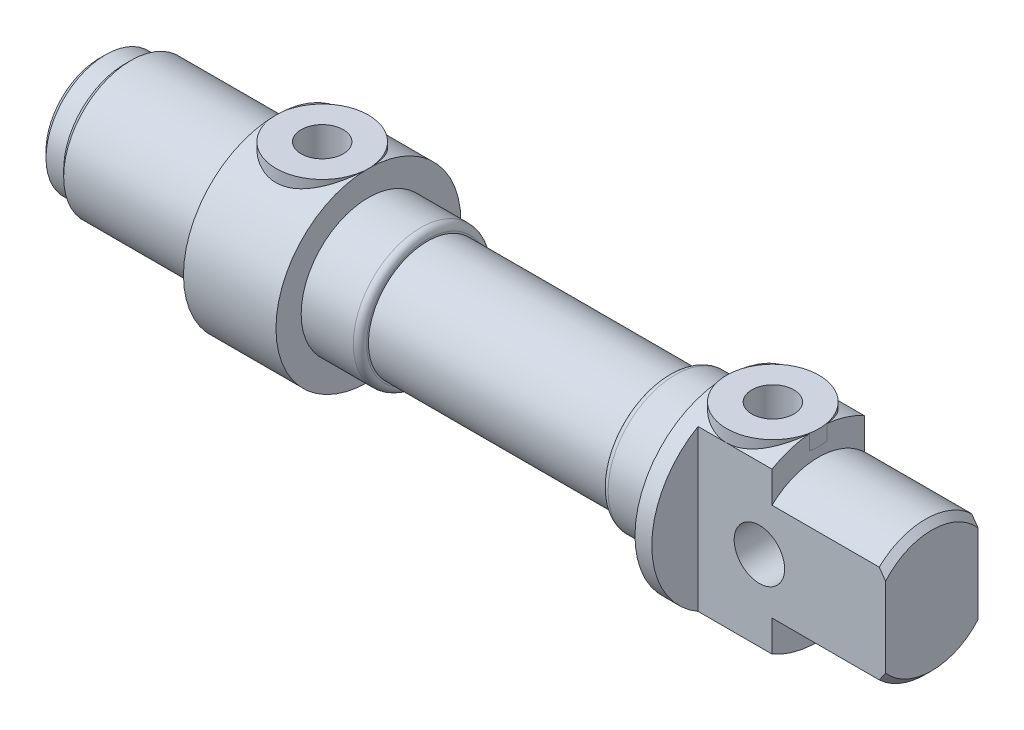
ISO-10303-21;
HEADER;
FILE_DESCRIPTION(('STEP AP214'),'2;1');
FILE_NAME('part.step','',(''),(''),'','','');
FILE_SCHEMA(('AUTOMOTIVE_DESIGN { 1 0 10303 214 1 1 1 1 }'));
ENDSEC;
DATA;
#1=APPLICATION_CONTEXT('core data for automotive mechanical design processes');
#2=APPLICATION_PROTOCOL_DEFINITION('international standard','automotive_design',2000,#1);
#3=PRODUCT_CONTEXT('',#1,'mechanical');
#4=PRODUCT('Part','Part','',(#3));
#5=PRODUCT_RELATED_PRODUCT_CATEGORY('part','',(#4));
#6=PRODUCT_DEFINITION_FORMATION('','',#4);
#7=PRODUCT_DEFINITION_CONTEXT('part definition',#1,'design');
#8=PRODUCT_DEFINITION('design','',#6,#7);
#9=PRODUCT_DEFINITION_SHAPE('','',#8);
#10=(LENGTH_UNIT() NAMED_UNIT(*) SI_UNIT(.MILLI.,.METRE.));
#11=(NAMED_UNIT(*) PLANE_ANGLE_UNIT() SI_UNIT($,.RADIAN.));
#12=(NAMED_UNIT(*) SI_UNIT($,.STERADIAN.) SOLID_ANGLE_UNIT());
#13=UNCERTAINTY_MEASURE_WITH_UNIT(LENGTH_MEASURE(1.E-05),#10,'distance_accuracy_value','');
#14=(GEOMETRIC_REPRESENTATION_CONTEXT(3) GLOBAL_UNCERTAINTY_ASSIGNED_CONTEXT((#13)) GLOBAL_UNIT_ASSIGNED_CONTEXT((#10,
#11,#12)) REPRESENTATION_CONTEXT('',''));
#15=CARTESIAN_POINT('',(0.,0.,0.));
#16=DIRECTION('',(0.,0.,1.));
#17=DIRECTION('',(1.,0.,0.));
#18=AXIS2_PLACEMENT_3D('',#15,#16,#17);
#19=CARTESIAN_POINT('',(0.,0.,0.));
#20=DIRECTION('',(-1.,0.,0.));
#21=DIRECTION('',(0.,0.,1.));
#22=AXIS2_PLACEMENT_3D('',#19,#20,#21);
#23=CYLINDRICAL_SURFACE('',#22,11.);
#24=CARTESIAN_POINT('',(53.7,0.,0.));
#25=DIRECTION('',(-1.,0.,0.));
#26=DIRECTION('',(0.,0.,1.));
#27=AXIS2_PLACEMENT_3D('',#24,#25,#26);
#28=CIRCLE('',#27,11.);
#29=CARTESIAN_POINT('',(53.7,10.9503424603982,-1.04403065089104));
#30=VERTEX_POINT('',#29);
#31=CARTESIAN_POINT('',(53.7,10.9503424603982,1.04403065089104));
#32=VERTEX_POINT('',#31);
#33=EDGE_CURVE('E276',#30,#32,#28,.T.);
#34=ORIENTED_EDGE('',*,*,#33,.F.);
#35=CARTESIAN_POINT('',(53.7,10.9503424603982,-1.04403065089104));
#36=CARTESIAN_POINT('',(53.7288948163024,10.9361080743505,-1.19358718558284));
#37=CARTESIAN_POINT('',(53.7639800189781,10.9188785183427,-1.34162139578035));
#38=CARTESIAN_POINT('',(53.8460015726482,10.8790225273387,-1.63352737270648));
#39=CARTESIAN_POINT('',(53.8929304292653,10.856399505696,-1.77740170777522));
#40=CARTESIAN_POINT('',(53.9979134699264,10.8064419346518,-2.05943303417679));
#41=CARTESIAN_POINT('',(54.0559172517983,10.7791287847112,-2.19761260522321));
#42=CARTESIAN_POINT('',(54.1825865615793,10.7204387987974,-2.46806995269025));
#43=CARTESIAN_POINT('',(54.2512535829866,10.6890613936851,-2.60034689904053));
#44=CARTESIAN_POINT('',(54.472058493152,10.5901125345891,-2.98660935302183));
#45=CARTESIAN_POINT('',(54.6393262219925,10.5175635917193,-3.23089286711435));
#46=CARTESIAN_POINT('',(55.0095866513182,10.3659488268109,-3.68856591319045));
#47=CARTESIAN_POINT('',(55.2126306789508,10.2868737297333,-3.90191024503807));
#48=CARTESIAN_POINT('',(55.665722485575,10.1240627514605,-4.30746707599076));
#49=CARTESIAN_POINT('',(55.9180545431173,10.0403843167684,-4.49718507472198));
#50=CARTESIAN_POINT('',(56.3195881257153,9.92291673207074,-4.74808501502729));
#51=CARTESIAN_POINT('',(56.4573490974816,9.88508507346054,-4.82613711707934));
#52=CARTESIAN_POINT('',(56.7398803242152,9.81333398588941,-4.97040750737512));
#53=CARTESIAN_POINT('',(56.8846469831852,9.77941257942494,-5.03663178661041));
#54=CARTESIAN_POINT('',(57.179025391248,9.7169769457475,-5.15605165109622));
#55=CARTESIAN_POINT('',(57.3285825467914,9.68841727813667,-5.20935795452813));
#56=CARTESIAN_POINT('',(57.6326487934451,9.63746232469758,-5.30303366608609));
#57=CARTESIAN_POINT('',(57.7871552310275,9.61506379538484,-5.34340988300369));
#58=CARTESIAN_POINT('',(58.0997925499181,9.57738812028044,-5.41064932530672));
#59=CARTESIAN_POINT('',(58.2579199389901,9.56210439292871,-5.43752504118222));
#60=CARTESIAN_POINT('',(58.5764659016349,9.539332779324,-5.47737752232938));
#61=CARTESIAN_POINT('',(58.7368841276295,9.53184372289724,-5.49035637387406));
#62=CARTESIAN_POINT('',(59.0381916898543,9.52544249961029,-5.50145172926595));
#63=CARTESIAN_POINT('',(59.1790024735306,9.525570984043,-5.50123060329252));
#64=CARTESIAN_POINT('',(59.4600963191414,9.53204711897,-5.49000191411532));
#65=CARTESIAN_POINT('',(59.6003791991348,9.53839674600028,-5.47899092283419));
#66=CARTESIAN_POINT('',(59.879260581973,9.55708643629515,-5.44632472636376));
#67=CARTESIAN_POINT('',(60.0178595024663,9.56942498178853,-5.424672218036));
#68=CARTESIAN_POINT('',(60.292439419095,9.59964806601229,-5.3710046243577));
#69=CARTESIAN_POINT('',(60.4284193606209,9.61753479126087,-5.33898545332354));
#70=CARTESIAN_POINT('',(60.8221387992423,9.67730391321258,-5.23034947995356));
#71=CARTESIAN_POINT('',(61.0751952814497,9.72601006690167,-5.13998574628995));
#72=CARTESIAN_POINT('',(61.5629532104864,9.83663704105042,-4.92494535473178));
#73=CARTESIAN_POINT('',(61.797649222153,9.89856175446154,-4.80025858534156));
#74=CARTESIAN_POINT('',(62.2706902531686,10.037255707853,-4.50369158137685));
#75=CARTESIAN_POINT('',(62.5064244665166,10.1149120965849,-4.32806054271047));
#76=CARTESIAN_POINT('',(62.9470237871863,10.2716646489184,-3.94161226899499));
#77=CARTESIAN_POINT('',(63.151858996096,10.3507621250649,-3.73076136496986));
#78=CARTESIAN_POINT('',(63.4408853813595,10.4682686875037,-3.38117498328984));
#79=CARTESIAN_POINT('',(63.5375625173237,10.508815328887,-3.25328033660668));
#80=CARTESIAN_POINT('',(63.7197292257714,10.5870262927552,-2.98895214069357));
#81=CARTESIAN_POINT('',(63.8052232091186,10.6246917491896,-2.8525219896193));
#82=CARTESIAN_POINT('',(63.9641582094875,10.6960272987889,-2.57213830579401));
#83=CARTESIAN_POINT('',(64.0376192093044,10.7297039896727,-2.42819778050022));
#84=CARTESIAN_POINT('',(64.1718831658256,10.7921485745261,-2.13358500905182));
#85=CARTESIAN_POINT('',(64.2326933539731,10.820919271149,-1.98291666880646));
#86=CARTESIAN_POINT('',(64.3318116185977,10.8683154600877,-1.70188960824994));
#87=CARTESIAN_POINT('',(64.3721860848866,10.8878338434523,-1.57240706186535));
#88=CARTESIAN_POINT('',(64.4433511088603,10.922476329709,-1.31036418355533));
#89=CARTESIAN_POINT('',(64.4741485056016,10.9376035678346,-1.17780612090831));
#90=CARTESIAN_POINT('',(64.5,10.9503424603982,-1.04403065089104));
#91=B_SPLINE_CURVE_WITH_KNOTS('',3,(#35,#36,#37,#38,#39,#40,#41,#42,#43,#44,#45,#46,#47,#48,#49,
#50,#51,#52,#53,#54,#55,#56,#57,#58,#59,#60,#61,#62,#63,#64,#65,#66,#67,#68,#69,#70,#71,#72,#73,
#74,#75,#76,#77,#78,#79,#80,#81,#82,#83,#84,#85,#86,#87,#88,#89,#90),.UNSPECIFIED.,.F.,.F.,(4,2,
2,2,2,2,2,2,2,2,2,2,2,2,2,2,2,2,2,2,2,2,2,2,2,2,2,4),(0.,0.458736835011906,0.917184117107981,
1.37359269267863,1.83006525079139,2.74022602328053,3.65170336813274,4.62644457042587,
5.11431993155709,5.60194747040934,6.08523477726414,6.56826717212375,7.05085184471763,
7.53336405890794,7.95525587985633,8.37728178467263,8.79920079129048,9.22128628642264,
10.0369075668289,10.8527693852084,11.7612570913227,12.6706183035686,13.1662054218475,
13.6615964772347,14.1561563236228,14.6504326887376,15.0610914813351,15.4714563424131),.UNSPECIFIED.);
#92=CARTESIAN_POINT('',(59.1,9.52627944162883,-5.5));
#93=VERTEX_POINT('',#92);
#94=EDGE_CURVE('E491',#30,#93,#91,.T.);
#95=ORIENTED_EDGE('',*,*,#94,.T.);
#96=DIRECTION('',(-1.,0.,0.));
#97=VECTOR('',#96,1.);
#98=CARTESIAN_POINT('',(0.,9.52627944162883,-5.49999999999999));
#99=LINE('',#98,#97);
#100=CARTESIAN_POINT('',(55.7,9.52627944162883,-5.5));
#101=VERTEX_POINT('',#100);
#102=EDGE_CURVE('E410',#93,#101,#99,.T.);
#103=ORIENTED_EDGE('',*,*,#102,.T.);
#104=CARTESIAN_POINT('',(55.7,0.,0.));
#105=DIRECTION('',(-1.,0.,0.));
#106=DIRECTION('',(0.,0.,1.));
#107=AXIS2_PLACEMENT_3D('',#104,#105,#106);
#108=CIRCLE('',#107,11.);
#109=CARTESIAN_POINT('',(55.7,-9.52627944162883,-5.5));
#110=VERTEX_POINT('',#109);
#111=EDGE_CURVE('E360',#101,#110,#108,.T.);
#112=ORIENTED_EDGE('',*,*,#111,.T.);
#113=DIRECTION('',(-1.,0.,0.));
#114=VECTOR('',#113,1.);
#115=CARTESIAN_POINT('',(0.,-9.52627944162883,-5.49999999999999));
#116=LINE('',#115,#114);
#117=CARTESIAN_POINT('',(64.5,-9.52627944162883,-5.5));
#118=VERTEX_POINT('',#117);
#119=EDGE_CURVE('E412',#110,#118,#116,.F.);
#120=ORIENTED_EDGE('',*,*,#119,.T.);
#121=CARTESIAN_POINT('',(64.5,0.,0.));
#122=DIRECTION('',(-1.,0.,0.));
#123=DIRECTION('',(0.,0.,1.));
#124=AXIS2_PLACEMENT_3D('',#121,#122,#123);
#125=CIRCLE('',#124,11.);
#126=CARTESIAN_POINT('',(64.5,-9.52627944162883,5.5));
#127=VERTEX_POINT('',#126);
#128=EDGE_CURVE('E273',#118,#127,#125,.T.);
#129=ORIENTED_EDGE('',*,*,#128,.T.);
#130=DIRECTION('',(-1.,0.,0.));
#131=VECTOR('',#130,1.);
#132=CARTESIAN_POINT('',(0.,-9.52627944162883,5.49999999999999));
#133=LINE('',#132,#131);
#134=CARTESIAN_POINT('',(55.7,-9.52627944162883,5.5));
#135=VERTEX_POINT('',#134);
#136=EDGE_CURVE('E393',#127,#135,#133,.T.);
#137=ORIENTED_EDGE('',*,*,#136,.T.);
#138=CARTESIAN_POINT('',(55.7,0.,0.));
#139=DIRECTION('',(-1.,0.,0.));
#140=DIRECTION('',(0.,0.,1.));
#141=AXIS2_PLACEMENT_3D('',#138,#139,#140);
#142=CIRCLE('',#141,11.);
#143=CARTESIAN_POINT('',(55.7,9.52627944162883,5.5));
#144=VERTEX_POINT('',#143);
#145=EDGE_CURVE('E11',#135,#144,#142,.T.);
#146=ORIENTED_EDGE('',*,*,#145,.T.);
#147=DIRECTION('',(-1.,0.,0.));
#148=VECTOR('',#147,1.);
#149=CARTESIAN_POINT('',(0.,9.52627944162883,5.49999999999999));
#150=LINE('',#149,#148);
#151=CARTESIAN_POINT('',(59.1,9.52627944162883,5.49999999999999));
#152=VERTEX_POINT('',#151);
#153=EDGE_CURVE('E391',#144,#152,#150,.F.);
#154=ORIENTED_EDGE('',*,*,#153,.T.);
#155=CARTESIAN_POINT('',(64.5,10.9503424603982,1.04403065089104));
#156=CARTESIAN_POINT('',(64.4711051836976,10.9361080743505,1.19358718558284));
#157=CARTESIAN_POINT('',(64.4360199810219,10.9188785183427,1.34162139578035));
#158=CARTESIAN_POINT('',(64.3539984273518,10.8790225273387,1.63352737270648));
#159=CARTESIAN_POINT('',(64.3070695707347,10.856399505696,1.77740170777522));
#160=CARTESIAN_POINT('',(64.2020865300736,10.8064419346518,2.0594330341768));
#161=CARTESIAN_POINT('',(64.1440827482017,10.7791287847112,2.19761260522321));
#162=CARTESIAN_POINT('',(64.0174134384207,10.7204387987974,2.46806995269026));
#163=CARTESIAN_POINT('',(63.9487464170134,10.6890613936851,2.60034689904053));
#164=CARTESIAN_POINT('',(63.727941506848,10.5901125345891,2.98660935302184));
#165=CARTESIAN_POINT('',(63.5606737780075,10.5175635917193,3.23089286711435));
#166=CARTESIAN_POINT('',(63.1904133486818,10.3659488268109,3.68856591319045));
#167=CARTESIAN_POINT('',(62.9873693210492,10.2868737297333,3.90191024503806));
#168=CARTESIAN_POINT('',(62.534277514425,10.1240627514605,4.30746707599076));
#169=CARTESIAN_POINT('',(62.2819454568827,10.0403843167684,4.49718507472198));
#170=CARTESIAN_POINT('',(61.8804118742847,9.92291673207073,4.74808501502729));
#171=CARTESIAN_POINT('',(61.7426509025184,9.88508507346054,4.82613711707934));
#172=CARTESIAN_POINT('',(61.4601196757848,9.81333398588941,4.97040750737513));
#173=CARTESIAN_POINT('',(61.3153530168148,9.77941257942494,5.03663178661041));
#174=CARTESIAN_POINT('',(61.020974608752,9.7169769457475,5.15605165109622));
#175=CARTESIAN_POINT('',(60.8714174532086,9.68841727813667,5.20935795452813));
#176=CARTESIAN_POINT('',(60.5673512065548,9.63746232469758,5.30303366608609));
#177=CARTESIAN_POINT('',(60.4128447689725,9.61506379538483,5.34340988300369));
#178=CARTESIAN_POINT('',(60.1002074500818,9.57738812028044,5.41064932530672));
#179=CARTESIAN_POINT('',(59.9420800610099,9.56210439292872,5.43752504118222));
#180=CARTESIAN_POINT('',(59.6235340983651,9.539332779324,5.47737752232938));
#181=CARTESIAN_POINT('',(59.4631158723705,9.53184372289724,5.49035637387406));
#182=CARTESIAN_POINT('',(59.1618083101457,9.52544249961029,5.50145172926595));
#183=CARTESIAN_POINT('',(59.0209975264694,9.525570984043,5.50123060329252));
#184=CARTESIAN_POINT('',(58.7399036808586,9.53204711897,5.49000191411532));
#185=CARTESIAN_POINT('',(58.5996208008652,9.53839674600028,5.47899092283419));
#186=CARTESIAN_POINT('',(58.3207394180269,9.55708643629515,5.44632472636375));
#187=CARTESIAN_POINT('',(58.1821404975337,9.56942498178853,5.424672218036));
#188=CARTESIAN_POINT('',(57.907560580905,9.5996480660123,5.37100462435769));
#189=CARTESIAN_POINT('',(57.7715806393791,9.61753479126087,5.33898545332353));
#190=CARTESIAN_POINT('',(57.3778612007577,9.67730391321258,5.23034947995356));
#191=CARTESIAN_POINT('',(57.1248047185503,9.72601006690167,5.13998574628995));
#192=CARTESIAN_POINT('',(56.6370467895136,9.83663704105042,4.92494535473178));
#193=CARTESIAN_POINT('',(56.4023507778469,9.89856175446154,4.80025858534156));
#194=CARTESIAN_POINT('',(55.9293097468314,10.037255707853,4.50369158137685));
#195=CARTESIAN_POINT('',(55.6935755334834,10.1149120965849,4.32806054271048));
#196=CARTESIAN_POINT('',(55.2529762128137,10.2716646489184,3.94161226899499));
#197=CARTESIAN_POINT('',(55.048141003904,10.3507621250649,3.73076136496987));
#198=CARTESIAN_POINT('',(54.7591146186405,10.4682686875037,3.38117498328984));
#199=CARTESIAN_POINT('',(54.6624374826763,10.508815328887,3.25328033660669));
#200=CARTESIAN_POINT('',(54.4802707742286,10.5870262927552,2.98895214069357));
#201=CARTESIAN_POINT('',(54.3947767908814,10.6246917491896,2.8525219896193));
#202=CARTESIAN_POINT('',(54.2358417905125,10.6960272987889,2.572138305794));
#203=CARTESIAN_POINT('',(54.1623807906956,10.7297039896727,2.42819778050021));
#204=CARTESIAN_POINT('',(54.0281168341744,10.7921485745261,2.13358500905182));
#205=CARTESIAN_POINT('',(53.9673066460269,10.820919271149,1.98291666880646));
#206=CARTESIAN_POINT('',(53.8681883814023,10.8683154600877,1.70188960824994));
#207=CARTESIAN_POINT('',(53.8278139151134,10.8878338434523,1.57240706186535));
#208=CARTESIAN_POINT('',(53.7566488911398,10.922476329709,1.31036418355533));
#209=CARTESIAN_POINT('',(53.7258514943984,10.9376035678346,1.17780612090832));
#210=CARTESIAN_POINT('',(53.7,10.9503424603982,1.04403065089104));
#211=B_SPLINE_CURVE_WITH_KNOTS('',3,(#155,#156,#157,#158,#159,#160,#161,#162,#163,#164,#165,
#166,#167,#168,#169,#170,#171,#172,#173,#174,#175,#176,#177,#178,#179,#180,#181,#182,#183,#184,
#185,#186,#187,#188,#189,#190,#191,#192,#193,#194,#195,#196,#197,#198,#199,#200,#201,#202,#203,
#204,#205,#206,#207,#208,#209,#210),.UNSPECIFIED.,.F.,.F.,(4,2,2,2,2,2,2,2,2,2,2,2,2,2,2,2,2,2,
2,2,2,2,2,2,2,2,2,4),(0.,0.458736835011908,0.917184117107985,1.37359269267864,1.83006525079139,
2.74022602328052,3.65170336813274,4.62644457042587,5.11431993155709,5.60194747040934,
6.08523477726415,6.56826717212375,7.05085184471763,7.53336405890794,7.95525587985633,
8.37728178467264,8.79920079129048,9.22128628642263,10.0369075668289,10.8527693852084,
11.7612570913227,12.6706183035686,13.1662054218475,13.6615964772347,14.1561563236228,
14.6504326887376,15.0610914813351,15.4714563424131),.UNSPECIFIED.);
#212=EDGE_CURVE('E39',#152,#32,#211,.T.);
#213=ORIENTED_EDGE('',*,*,#212,.T.);
#214=EDGE_LOOP('',(#34,#95,#103,#112,#120,#129,#137,#146,#154,#213));
#215=FACE_BOUND('',#214,.T.);
#216=ADVANCED_FACE('F24',(#215),#23,.T.);
#217=CARTESIAN_POINT('',(64.5,9.52627944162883,-5.5));
#218=VERTEX_POINT('',#217);
#219=EDGE_CURVE('E383',#218,#93,#99,.T.);
#220=ORIENTED_EDGE('',*,*,#219,.T.);
#221=CARTESIAN_POINT('',(64.5,10.9503424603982,-1.04403065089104));
#222=VERTEX_POINT('',#221);
#223=EDGE_CURVE('E420',#93,#222,#91,.T.);
#224=ORIENTED_EDGE('',*,*,#223,.T.);
#225=EDGE_CURVE('E274',#222,#218,#125,.T.);
#226=ORIENTED_EDGE('',*,*,#225,.T.);
#227=EDGE_LOOP('',(#220,#224,#226));
#228=FACE_BOUND('',#227,.T.);
#229=ADVANCED_FACE('F240',(#228),#23,.T.);
#230=CARTESIAN_POINT('',(0.,0.,0.));
#231=DIRECTION('',(-1.,0.,0.));
#232=DIRECTION('',(0.,0.,1.));
#233=AXIS2_PLACEMENT_3D('',#230,#231,#232);
#234=CYLINDRICAL_SURFACE('',#233,11.);
#235=CARTESIAN_POINT('',(0.,0.,0.));
#236=DIRECTION('',(-1.,0.,0.));
#237=DIRECTION('',(0.,0.,1.));
#238=AXIS2_PLACEMENT_3D('',#235,#236,#237);
#239=CIRCLE('',#238,11.);
#240=CARTESIAN_POINT('',(0.,11.,0.));
#241=VERTEX_POINT('',#240);
#242=EDGE_CURVE('E142',#241,#241,#239,.T.);
#243=ORIENTED_EDGE('',*,*,#242,.F.);
#244=CARTESIAN_POINT('',(5.5,9.52627944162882,5.5));
#245=CARTESIAN_POINT('',(5.643364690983,9.5262802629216,5.49999938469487));
#246=CARTESIAN_POINT('',(5.78674186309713,9.52952683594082,5.4943870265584));
#247=CARTESIAN_POINT('',(6.07239127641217,9.54239256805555,5.47201120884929));
#248=CARTESIAN_POINT('',(6.2146629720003,9.55201469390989,5.45524255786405));
#249=CARTESIAN_POINT('',(6.49716287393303,9.57729129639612,5.41074346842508));
#250=CARTESIAN_POINT('',(6.63738751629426,9.59295523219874,5.38299583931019));
#251=CARTESIAN_POINT('',(6.91462675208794,9.62975989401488,5.31687440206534));
#252=CARTESIAN_POINT('',(7.05163992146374,9.65090300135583,5.27849597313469));
#253=CARTESIAN_POINT('',(7.32076061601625,9.69782007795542,5.19179128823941));
#254=CARTESIAN_POINT('',(7.45289199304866,9.72356646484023,5.14352404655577));
#255=CARTESIAN_POINT('',(7.71239525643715,9.77898767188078,5.03735912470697));
#256=CARTESIAN_POINT('',(7.83976527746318,9.80866401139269,4.97945771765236));
#257=CARTESIAN_POINT('',(8.21369005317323,9.90232154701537,4.79202654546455));
#258=CARTESIAN_POINT('',(8.45231416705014,9.97097829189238,4.64868690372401));
#259=CARTESIAN_POINT('',(8.92271815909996,10.1198329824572,4.31565962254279));
#260=CARTESIAN_POINT('',(9.15231027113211,10.200515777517,4.12312437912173));
#261=CARTESIAN_POINT('',(9.57776111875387,10.3604667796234,3.70285774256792));
#262=CARTESIAN_POINT('',(9.77360302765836,10.4397342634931,3.47510889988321));
#263=CARTESIAN_POINT('',(10.0443505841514,10.5543291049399,3.10236472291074));
#264=CARTESIAN_POINT('',(10.1331048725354,10.5929291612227,2.96821996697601));
#265=CARTESIAN_POINT('',(10.2988911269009,10.6664816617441,2.69194359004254));
#266=CARTESIAN_POINT('',(10.3759277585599,10.7014355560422,2.54981517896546));
#267=CARTESIAN_POINT('',(10.5175139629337,10.7666847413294,2.25849127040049));
#268=CARTESIAN_POINT('',(10.5820667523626,10.7969812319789,2.10929760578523));
#269=CARTESIAN_POINT('',(10.6979740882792,10.8520196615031,1.80487667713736));
#270=CARTESIAN_POINT('',(10.7493300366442,10.8767621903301,1.64965005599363));
#271=CARTESIAN_POINT('',(10.8350170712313,10.9183839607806,1.34563480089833));
#272=CARTESIAN_POINT('',(10.8702991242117,10.9356972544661,1.19717331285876));
#273=CARTESIAN_POINT('',(10.9284630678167,10.9643772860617,0.897280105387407));
#274=CARTESIAN_POINT('',(10.9513461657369,10.9757446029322,0.745848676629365));
#275=CARTESIAN_POINT('',(10.9844019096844,10.9921999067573,0.441338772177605));
#276=CARTESIAN_POINT('',(10.9945806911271,10.9972909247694,0.288261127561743));
#277=CARTESIAN_POINT('',(11.0021057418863,11.0010524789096,-0.0182842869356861));
#278=CARTESIAN_POINT('',(10.9994527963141,10.9997234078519,-0.171752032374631));
#279=CARTESIAN_POINT('',(10.9821464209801,10.9910819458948,-0.464373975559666));
#280=CARTESIAN_POINT('',(10.9685603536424,10.9843017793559,-0.60360862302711));
#281=CARTESIAN_POINT('',(10.9308838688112,10.9655930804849,-0.880344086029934));
#282=CARTESIAN_POINT('',(10.9067901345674,10.9536629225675,-1.01784433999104));
#283=CARTESIAN_POINT('',(10.8483702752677,10.9249447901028,-1.2900821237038));
#284=CARTESIAN_POINT('',(10.8140475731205,10.9081584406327,-1.42482056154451));
#285=CARTESIAN_POINT('',(10.7355033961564,10.8701111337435,-1.69078120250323));
#286=CARTESIAN_POINT('',(10.6912781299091,10.8488484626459,-1.82200203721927));
#287=CARTESIAN_POINT('',(10.5926852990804,10.802015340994,-2.08185496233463));
#288=CARTESIAN_POINT('',(10.538189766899,10.7763909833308,-2.21042880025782));
#289=CARTESIAN_POINT('',(10.4199217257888,10.7216085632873,-2.46247345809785));
#290=CARTESIAN_POINT('',(10.3561458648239,10.6924492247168,-2.58594241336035));
#291=CARTESIAN_POINT('',(10.1516102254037,10.6005932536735,-2.94774083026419));
#292=CARTESIAN_POINT('',(9.99758211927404,10.5334891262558,-3.17761932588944));
#293=CARTESIAN_POINT('',(9.64206794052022,10.3864376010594,-3.6309893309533));
#294=CARTESIAN_POINT('',(9.4374720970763,10.3058757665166,-3.85182303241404));
#295=CARTESIAN_POINT('',(8.9947177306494,10.1449786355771,-4.25758842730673));
#296=CARTESIAN_POINT('',(8.75653362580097,10.0646435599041,-4.44249249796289));
#297=CARTESIAN_POINT('',(8.3696865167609,9.94829980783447,-4.69475077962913));
#298=CARTESIAN_POINT('',(8.23124381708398,9.90912969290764,-4.77664146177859));
#299=CARTESIAN_POINT('',(7.94693489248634,9.83456638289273,-4.92832970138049));
#300=CARTESIAN_POINT('',(7.80107182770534,9.7991715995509,-4.99813235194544));
#301=CARTESIAN_POINT('',(7.50287611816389,9.73346692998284,-5.12491225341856));
#302=CARTESIAN_POINT('',(7.35054745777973,9.70315396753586,-5.18189727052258));
#303=CARTESIAN_POINT('',(7.04041653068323,9.64881329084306,-5.28239263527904));
#304=CARTESIAN_POINT('',(6.88261501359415,9.6247847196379,-5.32590482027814));
#305=CARTESIAN_POINT('',(6.57551736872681,9.58568788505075,-5.3959305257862));
#306=CARTESIAN_POINT('',(6.42653689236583,9.5700608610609,-5.42351706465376));
#307=CARTESIAN_POINT('',(6.12626090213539,9.5456703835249,-5.46633229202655));
#308=CARTESIAN_POINT('',(5.97496567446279,9.53690608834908,-5.48156249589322));
#309=CARTESIAN_POINT('',(5.67147295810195,9.52661622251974,-5.49942639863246));
#310=CARTESIAN_POINT('',(5.51927603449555,9.52508651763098,-5.50206729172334));
#311=CARTESIAN_POINT('',(5.21529700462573,9.52932114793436,-5.49472990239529));
#312=CARTESIAN_POINT('',(5.06351487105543,9.53508499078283,-5.48475247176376));
#313=CARTESIAN_POINT('',(4.77830311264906,9.55263655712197,-5.45411820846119));
#314=CARTESIAN_POINT('',(4.64468761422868,9.56369369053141,-5.43475369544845));
#315=CARTESIAN_POINT('',(4.37974066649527,9.59101548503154,-5.38638840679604));
#316=CARTESIAN_POINT('',(4.24840993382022,9.60728175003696,-5.35738466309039));
#317=CARTESIAN_POINT('',(3.85911895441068,9.66316568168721,-5.2563532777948));
#318=CARTESIAN_POINT('',(3.60567427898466,9.70988100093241,-5.17028506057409));
#319=CARTESIAN_POINT('',(3.10519744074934,9.8194936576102,-4.95905569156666));
#320=CARTESIAN_POINT('',(2.85900593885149,9.88304025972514,-4.83226856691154));
#321=CARTESIAN_POINT('',(2.38992847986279,10.0185866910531,-4.5445776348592));
#322=CARTESIAN_POINT('',(2.16705458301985,10.090590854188,-4.38365630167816));
#323=CARTESIAN_POINT('',(1.72161945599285,10.2458377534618,-4.00861671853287));
#324=CARTESIAN_POINT('',(1.50263906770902,10.3293530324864,-3.7903497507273));
#325=CARTESIAN_POINT('',(1.10320928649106,10.4903919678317,-3.31867395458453));
#326=CARTESIAN_POINT('',(0.922772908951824,10.5679135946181,-3.06525330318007));
#327=CARTESIAN_POINT('',(0.683089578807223,10.6746136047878,-2.65951482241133));
#328=CARTESIAN_POINT('',(0.607571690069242,10.708972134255,-2.51794147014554));
#329=CARTESIAN_POINT('',(0.468867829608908,10.7730448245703,-2.22789327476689));
#330=CARTESIAN_POINT('',(0.405676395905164,10.8027610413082,-2.07942152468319));
#331=CARTESIAN_POINT('',(0.29236030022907,10.8566583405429,-1.77668429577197));
#332=CARTESIAN_POINT('',(0.242229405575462,10.8808420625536,-1.62242162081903));
#333=CARTESIAN_POINT('',(0.15564001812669,10.9229459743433,-1.30927195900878));
#334=CARTESIAN_POINT('',(0.119179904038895,10.9408669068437,-1.15038552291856));
#335=CARTESIAN_POINT('',(0.0631454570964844,10.9685392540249,-0.844141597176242));
#336=CARTESIAN_POINT('',(0.0423284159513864,10.9788895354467,-0.697064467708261));
#337=CARTESIAN_POINT('',(0.0126572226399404,10.9936692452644,-0.401416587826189));
#338=CARTESIAN_POINT('',(0.00380214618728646,10.9980991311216,-0.252845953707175));
#339=CARTESIAN_POINT('',(-0.00182957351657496,11.0009146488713,0.0445367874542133));
#340=CARTESIAN_POINT('',(0.0013902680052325,10.9993020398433,0.193348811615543));
#341=CARTESIAN_POINT('',(0.019858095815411,10.9900814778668,0.490034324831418));
#342=CARTESIAN_POINT('',(0.0351057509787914,10.9824736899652,0.637907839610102));
#343=CARTESIAN_POINT('',(0.0760284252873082,10.9621702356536,0.921802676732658));
#344=CARTESIAN_POINT('',(0.100946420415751,10.9498446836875,1.05796062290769));
#345=CARTESIAN_POINT('',(0.160838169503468,10.9204381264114,1.32756443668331));
#346=CARTESIAN_POINT('',(0.195815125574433,10.9033556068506,1.46100942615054));
#347=CARTESIAN_POINT('',(0.275467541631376,10.8648296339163,1.72428668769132));
#348=CARTESIAN_POINT('',(0.320140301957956,10.8433873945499,1.85411995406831));
#349=CARTESIAN_POINT('',(0.418782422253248,10.7966150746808,2.10950126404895));
#350=CARTESIAN_POINT('',(0.472755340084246,10.7712835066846,2.23504764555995));
#351=CARTESIAN_POINT('',(0.652943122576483,10.6879472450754,2.61467971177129));
#352=CARTESIAN_POINT('',(0.794068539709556,10.6242802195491,2.86064690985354));
#353=CARTESIAN_POINT('',(1.11078636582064,10.4878410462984,3.326301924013));
#354=CARTESIAN_POINT('',(1.2863946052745,10.4150647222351,3.54597759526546));
#355=CARTESIAN_POINT('',(1.68736745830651,10.2590780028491,3.97600893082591));
#356=CARTESIAN_POINT('',(1.91594456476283,10.1755500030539,4.18326133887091));
#357=CARTESIAN_POINT('',(2.40602812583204,10.0134581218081,4.5576740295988));
#358=CARTESIAN_POINT('',(2.66756340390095,9.93489867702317,4.72479884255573));
#359=CARTESIAN_POINT('',(3.0846415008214,9.82675425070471,4.94386827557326));
#360=CARTESIAN_POINT('',(3.23028892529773,9.79185569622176,5.01243240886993));
#361=CARTESIAN_POINT('',(3.52798104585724,9.72716768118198,5.13683980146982));
#362=CARTESIAN_POINT('',(3.68002239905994,9.69737559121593,5.1926896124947));
#363=CARTESIAN_POINT('',(3.98904865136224,9.64416228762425,5.29086476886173));
#364=CARTESIAN_POINT('',(4.14601966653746,9.62072470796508,5.33322490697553));
#365=CARTESIAN_POINT('',(4.46390136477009,9.58116263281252,5.40397782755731));
#366=CARTESIAN_POINT('',(4.62480921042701,9.56503302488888,5.43238037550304));
#367=CARTESIAN_POINT('',(4.90489766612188,9.54412294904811,5.46900539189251));
#368=CARTESIAN_POINT('',(5.02350660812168,9.53744790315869,5.48061724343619));
#369=CARTESIAN_POINT('',(5.26140745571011,9.52852565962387,5.49611506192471));
#370=CARTESIAN_POINT('',(5.38069940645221,9.52627875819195,5.50000051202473));
#371=CARTESIAN_POINT('',(5.5,9.52627944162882,5.5));
#372=B_SPLINE_CURVE_WITH_KNOTS('',3,(#244,#245,#246,#247,#248,#249,#250,#251,#252,#253,#254,
#255,#256,#257,#258,#259,#260,#261,#262,#263,#264,#265,#266,#267,#268,#269,#270,#271,#272,#273,
#274,#275,#276,#277,#278,#279,#280,#281,#282,#283,#284,#285,#286,#287,#288,#289,#290,#291,#292,
#293,#294,#295,#296,#297,#298,#299,#300,#301,#302,#303,#304,#305,#306,#307,#308,#309,#310,#311,
#312,#313,#314,#315,#316,#317,#318,#319,#320,#321,#322,#323,#324,#325,#326,#327,#328,#329,#330,
#331,#332,#333,#334,#335,#336,#337,#338,#339,#340,#341,#342,#343,#344,#345,#346,#347,#348,#349,
#350,#351,#352,#353,#354,#355,#356,#357,#358,#359,#360,#361,#362,#363,#364,#365,#366,#367,#368,
#369,#370,#371),.UNSPECIFIED.,.T.,.F.,(4,2,2,2,2,2,2,2,2,2,2,2,2,2,2,2,2,2,2,2,2,2,2,2,2,2,2,2,
2,2,2,2,2,2,2,2,2,2,2,2,2,2,2,2,2,2,2,2,2,2,2,2,2,2,2,2,2,2,2,2,2,2,2,4),(0.,0.429970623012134,
0.860141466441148,1.2909885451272,1.72202319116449,2.15055676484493,2.57925649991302,
3.43584921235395,4.36309194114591,5.29079563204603,5.78649985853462,6.2820061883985,
6.77738467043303,7.27271050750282,7.73281286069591,8.1928704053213,8.65270568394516,
9.11251282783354,9.53219720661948,9.95201415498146,10.3716907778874,10.7915283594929,
11.2169918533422,11.6426094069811,12.493336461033,13.4244805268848,14.3563376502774,
14.8524480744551,15.3483489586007,15.8439485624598,16.3394805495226,16.7957830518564,
17.2520295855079,17.7080153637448,18.1639703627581,18.569881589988,18.9759179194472,
19.7874357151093,20.6365391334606,21.4860795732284,22.4427087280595,23.3996604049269,
23.8913787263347,24.3828786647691,24.8741436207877,25.3653502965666,25.8114713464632,
26.2575579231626,26.703514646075,27.1494590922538,27.5658852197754,27.9824440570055,
28.3988870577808,28.8154897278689,29.6834896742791,30.5518890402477,31.5067116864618,
32.4623752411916,32.9559555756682,33.4492809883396,33.9413235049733,34.4330212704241,
34.7907963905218,35.1485954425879),.UNSPECIFIED.);
#373=CARTESIAN_POINT('',(11.,11.,0.));
#374=VERTEX_POINT('',#373);
#375=EDGE_CURVE('E477',#374,#241,#372,.T.);
#376=ORIENTED_EDGE('',*,*,#375,.F.);
#377=CARTESIAN_POINT('',(11.,0.,0.));
#378=DIRECTION('',(-1.,0.,0.));
#379=DIRECTION('',(0.,0.,1.));
#380=AXIS2_PLACEMENT_3D('',#377,#378,#379);
#381=CIRCLE('',#380,11.);
#382=EDGE_CURVE('E137',#374,#374,#381,.T.);
#383=ORIENTED_EDGE('',*,*,#382,.T.);
#384=CARTESIAN_POINT('',(5.5,9.52627944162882,5.5));
#385=CARTESIAN_POINT('',(5.643364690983,9.5262802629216,5.49999938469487));
#386=CARTESIAN_POINT('',(5.78674186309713,9.52952683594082,5.4943870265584));
#387=CARTESIAN_POINT('',(6.07239127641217,9.54239256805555,5.47201120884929));
#388=CARTESIAN_POINT('',(6.2146629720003,9.55201469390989,5.45524255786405));
#389=CARTESIAN_POINT('',(6.49716287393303,9.57729129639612,5.41074346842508));
#390=CARTESIAN_POINT('',(6.63738751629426,9.59295523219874,5.38299583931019));
#391=CARTESIAN_POINT('',(6.91462675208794,9.62975989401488,5.31687440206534));
#392=CARTESIAN_POINT('',(7.05163992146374,9.65090300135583,5.27849597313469));
#393=CARTESIAN_POINT('',(7.32076061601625,9.69782007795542,5.19179128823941));
#394=CARTESIAN_POINT('',(7.45289199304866,9.72356646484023,5.14352404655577));
#395=CARTESIAN_POINT('',(7.71239525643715,9.77898767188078,5.03735912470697));
#396=CARTESIAN_POINT('',(7.83976527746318,9.80866401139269,4.97945771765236));
#397=CARTESIAN_POINT('',(8.21369005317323,9.90232154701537,4.79202654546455));
#398=CARTESIAN_POINT('',(8.45231416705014,9.97097829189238,4.64868690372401));
#399=CARTESIAN_POINT('',(8.92271815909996,10.1198329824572,4.31565962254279));
#400=CARTESIAN_POINT('',(9.15231027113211,10.200515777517,4.12312437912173));
#401=CARTESIAN_POINT('',(9.57776111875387,10.3604667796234,3.70285774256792));
#402=CARTESIAN_POINT('',(9.77360302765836,10.4397342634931,3.47510889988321));
#403=CARTESIAN_POINT('',(10.0443505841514,10.5543291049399,3.10236472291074));
#404=CARTESIAN_POINT('',(10.1331048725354,10.5929291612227,2.96821996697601));
#405=CARTESIAN_POINT('',(10.2988911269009,10.6664816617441,2.69194359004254));
#406=CARTESIAN_POINT('',(10.3759277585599,10.7014355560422,2.54981517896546));
#407=CARTESIAN_POINT('',(10.5175139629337,10.7666847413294,2.25849127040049));
#408=CARTESIAN_POINT('',(10.5820667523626,10.7969812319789,2.10929760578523));
#409=CARTESIAN_POINT('',(10.6979740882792,10.8520196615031,1.80487667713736));
#410=CARTESIAN_POINT('',(10.7493300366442,10.8767621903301,1.64965005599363));
#411=CARTESIAN_POINT('',(10.8350170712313,10.9183839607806,1.34563480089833));
#412=CARTESIAN_POINT('',(10.8702991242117,10.9356972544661,1.19717331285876));
#413=CARTESIAN_POINT('',(10.9284630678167,10.9643772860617,0.897280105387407));
#414=CARTESIAN_POINT('',(10.9513461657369,10.9757446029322,0.745848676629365));
#415=CARTESIAN_POINT('',(10.9844019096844,10.9921999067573,0.441338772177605));
#416=CARTESIAN_POINT('',(10.9945806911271,10.9972909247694,0.288261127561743));
#417=CARTESIAN_POINT('',(11.0021057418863,11.0010524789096,-0.0182842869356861));
#418=CARTESIAN_POINT('',(10.9994527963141,10.9997234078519,-0.171752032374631));
#419=CARTESIAN_POINT('',(10.9821464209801,10.9910819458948,-0.464373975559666));
#420=CARTESIAN_POINT('',(10.9685603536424,10.9843017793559,-0.60360862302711));
#421=CARTESIAN_POINT('',(10.9308838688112,10.9655930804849,-0.880344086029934));
#422=CARTESIAN_POINT('',(10.9067901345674,10.9536629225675,-1.01784433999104));
#423=CARTESIAN_POINT('',(10.8483702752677,10.9249447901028,-1.2900821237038));
#424=CARTESIAN_POINT('',(10.8140475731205,10.9081584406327,-1.42482056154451));
#425=CARTESIAN_POINT('',(10.7355033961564,10.8701111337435,-1.69078120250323));
#426=CARTESIAN_POINT('',(10.6912781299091,10.8488484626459,-1.82200203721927));
#427=CARTESIAN_POINT('',(10.5926852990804,10.802015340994,-2.08185496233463));
#428=CARTESIAN_POINT('',(10.538189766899,10.7763909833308,-2.21042880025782));
#429=CARTESIAN_POINT('',(10.4199217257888,10.7216085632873,-2.46247345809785));
#430=CARTESIAN_POINT('',(10.3561458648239,10.6924492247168,-2.58594241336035));
#431=CARTESIAN_POINT('',(10.1516102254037,10.6005932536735,-2.94774083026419));
#432=CARTESIAN_POINT('',(9.99758211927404,10.5334891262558,-3.17761932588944));
#433=CARTESIAN_POINT('',(9.64206794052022,10.3864376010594,-3.6309893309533));
#434=CARTESIAN_POINT('',(9.4374720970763,10.3058757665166,-3.85182303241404));
#435=CARTESIAN_POINT('',(8.9947177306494,10.1449786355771,-4.25758842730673));
#436=CARTESIAN_POINT('',(8.75653362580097,10.0646435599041,-4.44249249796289));
#437=CARTESIAN_POINT('',(8.3696865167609,9.94829980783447,-4.69475077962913));
#438=CARTESIAN_POINT('',(8.23124381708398,9.90912969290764,-4.77664146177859));
#439=CARTESIAN_POINT('',(7.94693489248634,9.83456638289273,-4.92832970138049));
#440=CARTESIAN_POINT('',(7.80107182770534,9.7991715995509,-4.99813235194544));
#441=CARTESIAN_POINT('',(7.50287611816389,9.73346692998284,-5.12491225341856));
#442=CARTESIAN_POINT('',(7.35054745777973,9.70315396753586,-5.18189727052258));
#443=CARTESIAN_POINT('',(7.04041653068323,9.64881329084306,-5.28239263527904));
#444=CARTESIAN_POINT('',(6.88261501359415,9.6247847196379,-5.32590482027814));
#445=CARTESIAN_POINT('',(6.57551736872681,9.58568788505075,-5.3959305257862));
#446=CARTESIAN_POINT('',(6.42653689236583,9.5700608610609,-5.42351706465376));
#447=CARTESIAN_POINT('',(6.12626090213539,9.5456703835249,-5.46633229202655));
#448=CARTESIAN_POINT('',(5.97496567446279,9.53690608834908,-5.48156249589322));
#449=CARTESIAN_POINT('',(5.67147295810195,9.52661622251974,-5.49942639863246));
#450=CARTESIAN_POINT('',(5.51927603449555,9.52508651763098,-5.50206729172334));
#451=CARTESIAN_POINT('',(5.21529700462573,9.52932114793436,-5.49472990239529));
#452=CARTESIAN_POINT('',(5.06351487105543,9.53508499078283,-5.48475247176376));
#453=CARTESIAN_POINT('',(4.77830311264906,9.55263655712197,-5.45411820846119));
#454=CARTESIAN_POINT('',(4.64468761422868,9.56369369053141,-5.43475369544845));
#455=CARTESIAN_POINT('',(4.37974066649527,9.59101548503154,-5.38638840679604));
#456=CARTESIAN_POINT('',(4.24840993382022,9.60728175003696,-5.35738466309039));
#457=CARTESIAN_POINT('',(3.85911895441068,9.66316568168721,-5.2563532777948));
#458=CARTESIAN_POINT('',(3.60567427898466,9.70988100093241,-5.17028506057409));
#459=CARTESIAN_POINT('',(3.10519744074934,9.8194936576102,-4.95905569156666));
#460=CARTESIAN_POINT('',(2.85900593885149,9.88304025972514,-4.83226856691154));
#461=CARTESIAN_POINT('',(2.38992847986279,10.0185866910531,-4.5445776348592));
#462=CARTESIAN_POINT('',(2.16705458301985,10.090590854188,-4.38365630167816));
#463=CARTESIAN_POINT('',(1.72161945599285,10.2458377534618,-4.00861671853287));
#464=CARTESIAN_POINT('',(1.50263906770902,10.3293530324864,-3.7903497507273));
#465=CARTESIAN_POINT('',(1.10320928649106,10.4903919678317,-3.31867395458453));
#466=CARTESIAN_POINT('',(0.922772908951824,10.5679135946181,-3.06525330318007));
#467=CARTESIAN_POINT('',(0.683089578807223,10.6746136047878,-2.65951482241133));
#468=CARTESIAN_POINT('',(0.607571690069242,10.708972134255,-2.51794147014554));
#469=CARTESIAN_POINT('',(0.468867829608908,10.7730448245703,-2.22789327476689));
#470=CARTESIAN_POINT('',(0.405676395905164,10.8027610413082,-2.07942152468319));
#471=CARTESIAN_POINT('',(0.29236030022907,10.8566583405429,-1.77668429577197));
#472=CARTESIAN_POINT('',(0.242229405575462,10.8808420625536,-1.62242162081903));
#473=CARTESIAN_POINT('',(0.15564001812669,10.9229459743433,-1.30927195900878));
#474=CARTESIAN_POINT('',(0.119179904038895,10.9408669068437,-1.15038552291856));
#475=CARTESIAN_POINT('',(0.0631454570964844,10.9685392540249,-0.844141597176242));
#476=CARTESIAN_POINT('',(0.0423284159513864,10.9788895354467,-0.697064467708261));
#477=CARTESIAN_POINT('',(0.0126572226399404,10.9936692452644,-0.401416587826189));
#478=CARTESIAN_POINT('',(0.00380214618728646,10.9980991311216,-0.252845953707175));
#479=CARTESIAN_POINT('',(-0.00182957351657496,11.0009146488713,0.0445367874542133));
#480=CARTESIAN_POINT('',(0.0013902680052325,10.9993020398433,0.193348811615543));
#481=CARTESIAN_POINT('',(0.019858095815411,10.9900814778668,0.490034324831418));
#482=CARTESIAN_POINT('',(0.0351057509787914,10.9824736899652,0.637907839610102));
#483=CARTESIAN_POINT('',(0.0760284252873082,10.9621702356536,0.921802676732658));
#484=CARTESIAN_POINT('',(0.100946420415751,10.9498446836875,1.05796062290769));
#485=CARTESIAN_POINT('',(0.160838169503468,10.9204381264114,1.32756443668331));
#486=CARTESIAN_POINT('',(0.195815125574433,10.9033556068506,1.46100942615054));
#487=CARTESIAN_POINT('',(0.275467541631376,10.8648296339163,1.72428668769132));
#488=CARTESIAN_POINT('',(0.320140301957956,10.8433873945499,1.85411995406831));
#489=CARTESIAN_POINT('',(0.418782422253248,10.7966150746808,2.10950126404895));
#490=CARTESIAN_POINT('',(0.472755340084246,10.7712835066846,2.23504764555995));
#491=CARTESIAN_POINT('',(0.652943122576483,10.6879472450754,2.61467971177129));
#492=CARTESIAN_POINT('',(0.794068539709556,10.6242802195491,2.86064690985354));
#493=CARTESIAN_POINT('',(1.11078636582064,10.4878410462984,3.326301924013));
#494=CARTESIAN_POINT('',(1.2863946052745,10.4150647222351,3.54597759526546));
#495=CARTESIAN_POINT('',(1.68736745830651,10.2590780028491,3.97600893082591));
#496=CARTESIAN_POINT('',(1.91594456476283,10.1755500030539,4.18326133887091));
#497=CARTESIAN_POINT('',(2.40602812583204,10.0134581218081,4.5576740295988));
#498=CARTESIAN_POINT('',(2.66756340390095,9.93489867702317,4.72479884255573));
#499=CARTESIAN_POINT('',(3.0846415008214,9.82675425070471,4.94386827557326));
#500=CARTESIAN_POINT('',(3.23028892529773,9.79185569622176,5.01243240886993));
#501=CARTESIAN_POINT('',(3.52798104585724,9.72716768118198,5.13683980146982));
#502=CARTESIAN_POINT('',(3.68002239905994,9.69737559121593,5.1926896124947));
#503=CARTESIAN_POINT('',(3.98904865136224,9.64416228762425,5.29086476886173));
#504=CARTESIAN_POINT('',(4.14601966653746,9.62072470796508,5.33322490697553));
#505=CARTESIAN_POINT('',(4.46390136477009,9.58116263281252,5.40397782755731));
#506=CARTESIAN_POINT('',(4.62480921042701,9.56503302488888,5.43238037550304));
#507=CARTESIAN_POINT('',(4.90489766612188,9.54412294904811,5.46900539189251));
#508=CARTESIAN_POINT('',(5.02350660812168,9.53744790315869,5.48061724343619));
#509=CARTESIAN_POINT('',(5.26140745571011,9.52852565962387,5.49611506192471));
#510=CARTESIAN_POINT('',(5.38069940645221,9.52627875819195,5.50000051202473));
#511=CARTESIAN_POINT('',(5.5,9.52627944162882,5.5));
#512=B_SPLINE_CURVE_WITH_KNOTS('',3,(#384,#385,#386,#387,#388,#389,#390,#391,#392,#393,#394,
#395,#396,#397,#398,#399,#400,#401,#402,#403,#404,#405,#406,#407,#408,#409,#410,#411,#412,#413,
#414,#415,#416,#417,#418,#419,#420,#421,#422,#423,#424,#425,#426,#427,#428,#429,#430,#431,#432,
#433,#434,#435,#436,#437,#438,#439,#440,#441,#442,#443,#444,#445,#446,#447,#448,#449,#450,#451,
#452,#453,#454,#455,#456,#457,#458,#459,#460,#461,#462,#463,#464,#465,#466,#467,#468,#469,#470,
#471,#472,#473,#474,#475,#476,#477,#478,#479,#480,#481,#482,#483,#484,#485,#486,#487,#488,#489,
#490,#491,#492,#493,#494,#495,#496,#497,#498,#499,#500,#501,#502,#503,#504,#505,#506,#507,#508,
#509,#510,#511),.UNSPECIFIED.,.T.,.F.,(4,2,2,2,2,2,2,2,2,2,2,2,2,2,2,2,2,2,2,2,2,2,2,2,2,2,2,2,
2,2,2,2,2,2,2,2,2,2,2,2,2,2,2,2,2,2,2,2,2,2,2,2,2,2,2,2,2,2,2,2,2,2,2,4),(0.,0.429970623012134,
0.860141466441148,1.2909885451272,1.72202319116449,2.15055676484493,2.57925649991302,
3.43584921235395,4.36309194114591,5.29079563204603,5.78649985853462,6.2820061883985,
6.77738467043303,7.27271050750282,7.73281286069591,8.1928704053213,8.65270568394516,
9.11251282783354,9.53219720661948,9.95201415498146,10.3716907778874,10.7915283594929,
11.2169918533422,11.6426094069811,12.493336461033,13.4244805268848,14.3563376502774,
14.8524480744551,15.3483489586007,15.8439485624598,16.3394805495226,16.7957830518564,
17.2520295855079,17.7080153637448,18.1639703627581,18.569881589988,18.9759179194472,
19.7874357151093,20.6365391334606,21.4860795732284,22.4427087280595,23.3996604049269,
23.8913787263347,24.3828786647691,24.8741436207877,25.3653502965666,25.8114713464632,
26.2575579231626,26.703514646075,27.1494590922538,27.5658852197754,27.9824440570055,
28.3988870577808,28.8154897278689,29.6834896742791,30.5518890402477,31.5067116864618,
32.4623752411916,32.9559555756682,33.4492809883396,33.9413235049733,34.4330212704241,
34.7907963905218,35.1485954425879),.UNSPECIFIED.);
#513=EDGE_CURVE('E442',#241,#374,#512,.T.);
#514=ORIENTED_EDGE('',*,*,#513,.F.);
#515=EDGE_LOOP('',(#243,#376,#383,#514));
#516=FACE_BOUND('',#515,.T.);
#517=ADVANCED_FACE('F245',(#516),#234,.T.);
#518=CARTESIAN_POINT('',(64.5,11.,0.));
#519=DIRECTION('',(-1.,0.,0.));
#520=DIRECTION('',(0.,0.,1.));
#521=AXIS2_PLACEMENT_3D('',#518,#519,#520);
#522=PLANE('',#521);
#523=DIRECTION('',(0.,0.,1.));
#524=VECTOR('',#523,1.);
#525=CARTESIAN_POINT('',(64.5,9.16973763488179,0.));
#526=LINE('',#525,#524);
#527=CARTESIAN_POINT('',(64.5,9.16973763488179,-1.04403065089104));
#528=VERTEX_POINT('',#527);
#529=CARTESIAN_POINT('',(64.5,9.16973763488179,1.04403065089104));
#530=VERTEX_POINT('',#529);
#531=EDGE_CURVE('E448',#528,#530,#526,.T.);
#532=ORIENTED_EDGE('',*,*,#531,.T.);
#533=DIRECTION('',(0.,1.,0.));
#534=VECTOR('',#533,1.);
#535=CARTESIAN_POINT('',(64.5,-11.001,1.04403065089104));
#536=LINE('',#535,#534);
#537=CARTESIAN_POINT('',(64.5,10.9503424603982,1.04403065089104));
#538=VERTEX_POINT('',#537);
#539=EDGE_CURVE('E519',#530,#538,#536,.T.);
#540=ORIENTED_EDGE('',*,*,#539,.T.);
#541=CARTESIAN_POINT('',(64.5,9.52627944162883,5.5));
#542=VERTEX_POINT('',#541);
#543=EDGE_CURVE('E265',#542,#538,#125,.T.);
#544=ORIENTED_EDGE('',*,*,#543,.F.);
#545=DIRECTION('',(0.,-1.,0.));
#546=VECTOR('',#545,1.);
#547=CARTESIAN_POINT('',(64.5,11.,5.5));
#548=LINE('',#547,#546);
#549=CARTESIAN_POINT('',(64.5,5.80947501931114,5.49999999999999));
#550=VERTEX_POINT('',#549);
#551=EDGE_CURVE('E395',#542,#550,#548,.T.);
#552=ORIENTED_EDGE('',*,*,#551,.T.);
#553=CARTESIAN_POINT('',(64.5,0.,0.));
#554=DIRECTION('',(-1.,0.,0.));
#555=DIRECTION('',(0.,0.,1.));
#556=AXIS2_PLACEMENT_3D('',#553,#554,#555);
#557=CIRCLE('',#556,8.);
#558=CARTESIAN_POINT('',(64.5,5.80947501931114,-5.49999999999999));
#559=VERTEX_POINT('',#558);
#560=EDGE_CURVE('E413',#550,#559,#557,.T.);
#561=ORIENTED_EDGE('',*,*,#560,.T.);
#562=DIRECTION('',(0.,1.,0.));
#563=VECTOR('',#562,1.);
#564=CARTESIAN_POINT('',(64.5,11.,-5.5));
#565=LINE('',#564,#563);
#566=EDGE_CURVE('E407',#559,#218,#565,.T.);
#567=ORIENTED_EDGE('',*,*,#566,.T.);
#568=ORIENTED_EDGE('',*,*,#225,.F.);
#569=DIRECTION('',(0.,1.,0.));
#570=VECTOR('',#569,1.);
#571=CARTESIAN_POINT('',(64.5,-11.001,-1.04403065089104));
#572=LINE('',#571,#570);
#573=EDGE_CURVE('E424',#222,#528,#572,.F.);
#574=ORIENTED_EDGE('',*,*,#573,.T.);
#575=EDGE_LOOP('',(#532,#540,#544,#552,#561,#567,#568,#574));
#576=FACE_BOUND('',#575,.T.);
#577=ADVANCED_FACE('F259',(#576),#522,.F.);
#578=CARTESIAN_POINT('',(0.,0.,0.));
#579=DIRECTION('',(-1.,0.,0.));
#580=DIRECTION('',(0.,0.,1.));
#581=AXIS2_PLACEMENT_3D('',#578,#579,#580);
#582=CYLINDRICAL_SURFACE('',#581,8.);
#583=CARTESIAN_POINT('',(77.25,0.,0.));
#584=DIRECTION('',(-1.,0.,0.));
#585=DIRECTION('',(0.,0.,1.));
#586=AXIS2_PLACEMENT_3D('',#583,#584,#585);
#587=CIRCLE('',#586,8.);
#588=CARTESIAN_POINT('',(77.25,-5.80947501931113,-5.5));
#589=VERTEX_POINT('',#588);
#590=CARTESIAN_POINT('',(77.25,-5.80947501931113,5.5));
#591=VERTEX_POINT('',#590);
#592=EDGE_CURVE('E165',#589,#591,#587,.T.);
#593=ORIENTED_EDGE('',*,*,#592,.T.);
#594=DIRECTION('',(-1.,0.,0.));
#595=VECTOR('',#594,1.);
#596=CARTESIAN_POINT('',(0.,-5.80947501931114,5.49999999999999));
#597=LINE('',#596,#595);
#598=CARTESIAN_POINT('',(64.5,-5.80947501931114,5.49999999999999));
#599=VERTEX_POINT('',#598);
#600=EDGE_CURVE('E387',#591,#599,#597,.T.);
#601=ORIENTED_EDGE('',*,*,#600,.T.);
#602=CARTESIAN_POINT('',(64.5,-5.80947501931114,-5.49999999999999));
#603=VERTEX_POINT('',#602);
#604=EDGE_CURVE('E277',#603,#599,#557,.T.);
#605=ORIENTED_EDGE('',*,*,#604,.F.);
#606=DIRECTION('',(-1.,0.,0.));
#607=VECTOR('',#606,1.);
#608=CARTESIAN_POINT('',(0.,-5.80947501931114,-5.49999999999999));
#609=LINE('',#608,#607);
#610=EDGE_CURVE('E375',#603,#589,#609,.F.);
#611=ORIENTED_EDGE('',*,*,#610,.T.);
#612=EDGE_LOOP('',(#593,#601,#605,#611));
#613=FACE_BOUND('',#612,.T.);
#614=ADVANCED_FACE('F345',(#613),#582,.T.);
#615=CARTESIAN_POINT('',(77.25,0.,0.));
#616=DIRECTION('',(-1.,0.,0.));
#617=DIRECTION('',(0.,0.,1.));
#618=AXIS2_PLACEMENT_3D('',#615,#616,#617);
#619=CONICAL_SURFACE('',#618,8.,0.785398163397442);
#620=CARTESIAN_POINT('',(71.2396109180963,-12.8856898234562,5.5));
#621=CARTESIAN_POINT('',(71.5054541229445,-12.5966097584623,5.5));
#622=CARTESIAN_POINT('',(71.770584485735,-12.3068695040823,5.5));
#623=CARTESIAN_POINT('',(72.2990330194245,-11.725715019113,5.5));
#624=CARTESIAN_POINT('',(72.56235109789,-11.4343007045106,5.5));
#625=CARTESIAN_POINT('',(73.086942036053,-10.8492724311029,5.5));
#626=CARTESIAN_POINT('',(73.3482133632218,-10.5556570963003,5.5));
#627=CARTESIAN_POINT('',(73.867953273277,-9.96596311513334,5.5));
#628=CARTESIAN_POINT('',(74.126421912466,-9.66988451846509,5.5));
#629=CARTESIAN_POINT('',(74.6357900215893,-9.07928706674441,5.5));
#630=CARTESIAN_POINT('',(74.8867446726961,-8.78481588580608,5.5));
#631=CARTESIAN_POINT('',(75.3841672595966,-8.19210975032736,5.5));
#632=CARTESIAN_POINT('',(75.6306353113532,-7.89387489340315,5.5));
#633=CARTESIAN_POINT('',(76.1177130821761,-7.29244915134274,5.5));
#634=CARTESIAN_POINT('',(76.3583204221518,-6.98925633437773,5.5));
#635=CARTESIAN_POINT('',(76.8314015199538,-6.3765854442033,5.5));
#636=CARTESIAN_POINT('',(77.0638761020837,-6.06710801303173,5.5));
#637=CARTESIAN_POINT('',(77.4054406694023,-5.59455713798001,5.5));
#638=CARTESIAN_POINT('',(77.5188177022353,-5.43458296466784,5.5));
#639=CARTESIAN_POINT('',(77.7419719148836,-5.1121479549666,5.5));
#640=CARTESIAN_POINT('',(77.8517492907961,-4.94968725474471,5.5));
#641=CARTESIAN_POINT('',(78.066737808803,-4.62217351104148,5.5));
#642=CARTESIAN_POINT('',(78.171956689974,-4.45712556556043,5.5));
#643=CARTESIAN_POINT('',(78.377016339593,-4.12373415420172,5.5));
#644=CARTESIAN_POINT('',(78.4768577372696,-3.95539107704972,5.5));
#645=CARTESIAN_POINT('',(78.6707302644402,-3.61342043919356,5.5));
#646=CARTESIAN_POINT('',(78.7647030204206,-3.43975956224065,5.5));
#647=CARTESIAN_POINT('',(78.9441307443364,-3.08817530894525,5.5));
#648=CARTESIAN_POINT('',(79.0295899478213,-2.91025410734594,5.5));
#649=CARTESIAN_POINT('',(79.1904153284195,-2.54852519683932,5.5));
#650=CARTESIAN_POINT('',(79.2657165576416,-2.36468813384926,5.5));
#651=CARTESIAN_POINT('',(79.4030216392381,-1.9917732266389,5.5));
#652=CARTESIAN_POINT('',(79.4650015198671,-1.80268661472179,5.5));
#653=CARTESIAN_POINT('',(79.5188870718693,-1.61110378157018,5.5));
#654=B_SPLINE_CURVE_WITH_KNOTS('',3,(#620,#621,#622,#623,#624,#625,#626,#627,#628,#629,#630,
#631,#632,#633,#634,#635,#636,#637,#638,#639,#640,#641,#642,#643,#644,#645,#646,#647,#648,#649,
#650,#651,#652,#653),.UNSPECIFIED.,.F.,.F.,(4,2,2,2,2,2,2,2,2,2,2,2,2,2,2,2,4),(0.,
1.17820553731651,2.35647072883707,3.53554694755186,4.71459943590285,5.87526601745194,
7.03590255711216,8.19700264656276,9.35798470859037,9.94617685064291,10.5343368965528,
11.1214557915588,11.7085058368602,12.3006839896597,12.8925660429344,13.488069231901,
14.0846352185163),.UNSPECIFIED.);
#655=CARTESIAN_POINT('',(78.,-4.72361090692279,5.5));
#656=VERTEX_POINT('',#655);
#657=EDGE_CURVE('E32',#591,#656,#654,.T.);
#658=ORIENTED_EDGE('',*,*,#657,.F.);
#659=ORIENTED_EDGE('',*,*,#592,.F.);
#660=CARTESIAN_POINT('',(79.5188870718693,-1.61110378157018,-5.5));
#661=CARTESIAN_POINT('',(79.4849523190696,-1.73182242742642,-5.5));
#662=CARTESIAN_POINT('',(79.4477728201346,-1.85158163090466,-5.5));
#663=CARTESIAN_POINT('',(79.36766929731,-2.08909000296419,-5.5));
#664=CARTESIAN_POINT('',(79.3247486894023,-2.20684032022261,-5.5));
#665=CARTESIAN_POINT('',(79.188672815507,-2.55651640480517,-5.5));
#666=CARTESIAN_POINT('',(79.088010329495,-2.78552635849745,-5.5));
#667=CARTESIAN_POINT('',(78.8724733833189,-3.23439646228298,-5.5));
#668=CARTESIAN_POINT('',(78.7577164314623,-3.45431423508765,-5.5));
#669=CARTESIAN_POINT('',(78.5169289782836,-3.88802898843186,-5.5));
#670=CARTESIAN_POINT('',(78.3908909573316,-4.10182175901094,-5.5));
#671=CARTESIAN_POINT('',(78.1087962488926,-4.55898219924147,-5.5));
#672=CARTESIAN_POINT('',(77.9512187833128,-4.801405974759,-5.5));
#673=CARTESIAN_POINT('',(77.7082165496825,-5.16103468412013,-5.5));
#674=CARTESIAN_POINT('',(77.6259801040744,-5.280420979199,-5.5));
#675=CARTESIAN_POINT('',(77.4596279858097,-5.5178880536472,-5.5));
#676=CARTESIAN_POINT('',(77.3755122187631,-5.63596876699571,-5.5));
#677=CARTESIAN_POINT('',(77.1752952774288,-5.9129527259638,-5.5));
#678=CARTESIAN_POINT('',(77.0585088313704,-6.07136013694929,-5.5));
#679=CARTESIAN_POINT('',(76.8224286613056,-6.38629769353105,-5.5));
#680=CARTESIAN_POINT('',(76.7031348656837,-6.54282778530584,-5.5));
#681=CARTESIAN_POINT('',(76.3420747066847,-7.01001789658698,-5.5));
#682=CARTESIAN_POINT('',(76.0971556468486,-7.31824206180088,-5.5));
#683=CARTESIAN_POINT('',(75.601060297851,-7.92994089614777,-5.5));
#684=CARTESIAN_POINT('',(75.3498797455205,-8.23341208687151,-5.5));
#685=CARTESIAN_POINT('',(74.8429288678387,-8.83650361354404,-5.5));
#686=CARTESIAN_POINT('',(74.5871584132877,-9.13612384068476,-5.5));
#687=CARTESIAN_POINT('',(74.07701078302,-9.72663089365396,-5.5));
#688=CARTESIAN_POINT('',(73.8227000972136,-10.0175752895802,-5.5));
#689=CARTESIAN_POINT('',(73.3114003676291,-10.5971102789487,-5.5));
#690=CARTESIAN_POINT('',(73.0544112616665,-10.8857008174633,-5.5));
#691=CARTESIAN_POINT('',(72.538768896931,-11.4604325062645,-5.5));
#692=CARTESIAN_POINT('',(72.2801195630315,-11.7465771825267,-5.5));
#693=CARTESIAN_POINT('',(71.7610800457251,-12.3172570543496,-5.5));
#694=CARTESIAN_POINT('',(71.5006899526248,-12.60179233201,-5.5));
#695=CARTESIAN_POINT('',(71.2396109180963,-12.8856898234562,-5.5));
#696=B_SPLINE_CURVE_WITH_KNOTS('',3,(#660,#661,#662,#663,#664,#665,#666,#667,#668,#669,#670,
#671,#672,#673,#674,#675,#676,#677,#678,#679,#680,#681,#682,#683,#684,#685,#686,#687,#688,#689,
#690,#691,#692,#693,#694,#695),.UNSPECIFIED.,.F.,.F.,(4,2,2,2,2,2,2,2,2,2,2,2,2,2,2,2,2,4),(0.,
0.376076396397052,0.751930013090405,1.50158468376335,2.24536684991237,2.98964854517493,
3.85679562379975,4.29168940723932,4.72660508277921,5.31698751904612,5.90738684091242,
7.08831803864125,8.27007651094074,9.45186830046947,10.6111169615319,11.7703925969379,
12.9275383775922,14.0846245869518),.UNSPECIFIED.);
#697=CARTESIAN_POINT('',(78.,-4.72361090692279,-5.5));
#698=VERTEX_POINT('',#697);
#699=EDGE_CURVE('E197',#698,#589,#696,.T.);
#700=ORIENTED_EDGE('',*,*,#699,.F.);
#701=CARTESIAN_POINT('',(78.,0.,0.));
#702=DIRECTION('',(-1.,0.,0.));
#703=DIRECTION('',(0.,0.,1.));
#704=AXIS2_PLACEMENT_3D('',#701,#702,#703);
#705=CIRCLE('',#704,7.25);
#706=EDGE_CURVE('E168',#656,#698,#705,.F.);
#707=ORIENTED_EDGE('',*,*,#706,.F.);
#708=EDGE_LOOP('',(#658,#659,#700,#707));
#709=FACE_BOUND('',#708,.T.);
#710=ADVANCED_FACE('F236',(#709),#619,.T.);
#711=CARTESIAN_POINT('',(78.,8.,0.));
#712=DIRECTION('',(-1.,0.,0.));
#713=DIRECTION('',(0.,0.,1.));
#714=AXIS2_PLACEMENT_3D('',#711,#712,#713);
#715=PLANE('',#714);
#716=CARTESIAN_POINT('',(78.,4.72361090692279,-5.5));
#717=VERTEX_POINT('',#716);
#718=CARTESIAN_POINT('',(78.,4.72361090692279,5.5));
#719=VERTEX_POINT('',#718);
#720=EDGE_CURVE('E169',#717,#719,#705,.F.);
#721=ORIENTED_EDGE('',*,*,#720,.T.);
#722=DIRECTION('',(0.,1.,0.));
#723=VECTOR('',#722,1.);
#724=CARTESIAN_POINT('',(78.,-11.,5.5));
#725=LINE('',#724,#723);
#726=EDGE_CURVE('E350',#656,#719,#725,.T.);
#727=ORIENTED_EDGE('',*,*,#726,.F.);
#728=ORIENTED_EDGE('',*,*,#706,.T.);
#729=DIRECTION('',(0.,1.,0.));
#730=VECTOR('',#729,1.);
#731=CARTESIAN_POINT('',(78.,-11.,-5.5));
#732=LINE('',#731,#730);
#733=EDGE_CURVE('E353',#698,#717,#732,.T.);
#734=ORIENTED_EDGE('',*,*,#733,.T.);
#735=EDGE_LOOP('',(#721,#727,#728,#734));
#736=FACE_BOUND('',#735,.T.);
#737=ADVANCED_FACE('F338',(#736),#715,.F.);
#738=CARTESIAN_POINT('',(-21.,7.1,0.));
#739=DIRECTION('',(1.,0.,0.));
#740=DIRECTION('',(0.,0.,-1.));
#741=AXIS2_PLACEMENT_3D('',#738,#739,#740);
#742=PLANE('',#741);
#743=CARTESIAN_POINT('',(-21.,0.,0.));
#744=DIRECTION('',(-1.,0.,0.));
#745=DIRECTION('',(0.,0.,1.));
#746=AXIS2_PLACEMENT_3D('',#743,#744,#745);
#747=CIRCLE('',#746,3.);
#748=CARTESIAN_POINT('',(-21.,0.,3.));
#749=VERTEX_POINT('',#748);
#750=EDGE_CURVE('E641',#749,#749,#747,.T.);
#751=ORIENTED_EDGE('',*,*,#750,.F.);
#752=EDGE_LOOP('',(#751));
#753=FACE_BOUND('',#752,.T.);
#754=CARTESIAN_POINT('',(-21.,0.,0.));
#755=DIRECTION('',(1.,0.,0.));
#756=DIRECTION('',(0.,0.,-1.));
#757=AXIS2_PLACEMENT_3D('',#754,#755,#756);
#758=CIRCLE('',#757,6.34999999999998);
#759=CARTESIAN_POINT('',(-21.,0.,-6.34999999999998));
#760=VERTEX_POINT('',#759);
#761=EDGE_CURVE('E172',#760,#760,#758,.F.);
#762=ORIENTED_EDGE('',*,*,#761,.T.);
#763=EDGE_LOOP('',(#762));
#764=FACE_BOUND('',#763,.T.);
#765=ADVANCED_FACE('F335',(#753,#764),#742,.F.);
#766=CARTESIAN_POINT('',(0.,0.,0.));
#767=DIRECTION('',(-1.,0.,0.));
#768=DIRECTION('',(0.,0.,1.));
#769=AXIS2_PLACEMENT_3D('',#766,#767,#768);
#770=CYLINDRICAL_SURFACE('',#769,7.1);
#771=CARTESIAN_POINT('',(-20.25,0.,0.));
#772=DIRECTION('',(1.,0.,0.));
#773=DIRECTION('',(0.,0.,-1.));
#774=AXIS2_PLACEMENT_3D('',#771,#772,#773);
#775=CIRCLE('',#774,7.1);
#776=CARTESIAN_POINT('',(-20.25,0.,-7.1));
#777=VERTEX_POINT('',#776);
#778=EDGE_CURVE('E175',#777,#777,#775,.T.);
#779=ORIENTED_EDGE('',*,*,#778,.T.);
#780=EDGE_LOOP('',(#779));
#781=FACE_BOUND('',#780,.T.);
#782=CARTESIAN_POINT('',(-18.,0.,0.));
#783=DIRECTION('',(-1.,0.,0.));
#784=DIRECTION('',(0.,0.,1.));
#785=AXIS2_PLACEMENT_3D('',#782,#783,#784);
#786=CIRCLE('',#785,7.1);
#787=CARTESIAN_POINT('',(-18.,0.,7.1));
#788=VERTEX_POINT('',#787);
#789=EDGE_CURVE('E155',#788,#788,#786,.T.);
#790=ORIENTED_EDGE('',*,*,#789,.T.);
#791=EDGE_LOOP('',(#790));
#792=FACE_BOUND('',#791,.T.);
#793=ADVANCED_FACE('F331',(#781,#792),#770,.T.);
#794=CARTESIAN_POINT('',(-18.,8.,0.));
#795=DIRECTION('',(1.,0.,0.));
#796=DIRECTION('',(0.,0.,-1.));
#797=AXIS2_PLACEMENT_3D('',#794,#795,#796);
#798=PLANE('',#797);
#799=CARTESIAN_POINT('',(-18.,0.,0.));
#800=DIRECTION('',(1.,0.,0.));
#801=DIRECTION('',(0.,0.,-1.));
#802=AXIS2_PLACEMENT_3D('',#799,#800,#801);
#803=CIRCLE('',#802,7.24999999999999);
#804=CARTESIAN_POINT('',(-18.,0.,-7.24999999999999));
#805=VERTEX_POINT('',#804);
#806=EDGE_CURVE('E158',#805,#805,#803,.F.);
#807=ORIENTED_EDGE('',*,*,#806,.T.);
#808=EDGE_LOOP('',(#807));
#809=FACE_BOUND('',#808,.T.);
#810=ORIENTED_EDGE('',*,*,#789,.F.);
#811=EDGE_LOOP('',(#810));
#812=FACE_BOUND('',#811,.T.);
#813=ADVANCED_FACE('F327',(#809,#812),#798,.F.);
#814=CARTESIAN_POINT('',(0.,0.,0.));
#815=DIRECTION('',(-1.,0.,0.));
#816=DIRECTION('',(0.,0.,1.));
#817=AXIS2_PLACEMENT_3D('',#814,#815,#816);
#818=CYLINDRICAL_SURFACE('',#817,8.);
#819=CARTESIAN_POINT('',(-17.25,0.,0.));
#820=DIRECTION('',(1.,0.,0.));
#821=DIRECTION('',(0.,0.,-1.));
#822=AXIS2_PLACEMENT_3D('',#819,#820,#821);
#823=CIRCLE('',#822,8.);
#824=CARTESIAN_POINT('',(-17.25,0.,-8.));
#825=VERTEX_POINT('',#824);
#826=EDGE_CURVE('E161',#825,#825,#823,.T.);
#827=ORIENTED_EDGE('',*,*,#826,.T.);
#828=EDGE_LOOP('',(#827));
#829=FACE_BOUND('',#828,.T.);
#830=CARTESIAN_POINT('',(0.,0.,0.));
#831=DIRECTION('',(-1.,0.,0.));
#832=DIRECTION('',(0.,0.,1.));
#833=AXIS2_PLACEMENT_3D('',#830,#831,#832);
#834=CIRCLE('',#833,8.);
#835=CARTESIAN_POINT('',(0.,0.,8.));
#836=VERTEX_POINT('',#835);
#837=EDGE_CURVE('E146',#836,#836,#834,.T.);
#838=ORIENTED_EDGE('',*,*,#837,.T.);
#839=EDGE_LOOP('',(#838));
#840=FACE_BOUND('',#839,.T.);
#841=ADVANCED_FACE('F323',(#829,#840),#818,.T.);
#842=CARTESIAN_POINT('',(0.,11.,0.));
#843=DIRECTION('',(1.,0.,0.));
#844=DIRECTION('',(0.,0.,-1.));
#845=AXIS2_PLACEMENT_3D('',#842,#843,#844);
#846=PLANE('',#845);
#847=ORIENTED_EDGE('',*,*,#837,.F.);
#848=EDGE_LOOP('',(#847));
#849=FACE_BOUND('',#848,.T.);
#850=ORIENTED_EDGE('',*,*,#242,.T.);
#851=EDGE_LOOP('',(#850));
#852=FACE_BOUND('',#851,.T.);
#853=ADVANCED_FACE('F318',(#849,#852),#846,.F.);
#854=CARTESIAN_POINT('',(11.,11.,0.));
#855=DIRECTION('',(-1.,0.,0.));
#856=DIRECTION('',(0.,0.,1.));
#857=AXIS2_PLACEMENT_3D('',#854,#855,#856);
#858=PLANE('',#857);
#859=ORIENTED_EDGE('',*,*,#382,.F.);
#860=EDGE_LOOP('',(#859));
#861=FACE_BOUND('',#860,.T.);
#862=CARTESIAN_POINT('',(11.,0.,0.));
#863=DIRECTION('',(-1.,0.,0.));
#864=DIRECTION('',(0.,0.,1.));
#865=AXIS2_PLACEMENT_3D('',#862,#863,#864);
#866=CIRCLE('',#865,8.);
#867=CARTESIAN_POINT('',(11.,0.,8.));
#868=VERTEX_POINT('',#867);
#869=EDGE_CURVE('E143',#868,#868,#866,.T.);
#870=ORIENTED_EDGE('',*,*,#869,.T.);
#871=EDGE_LOOP('',(#870));
#872=FACE_BOUND('',#871,.T.);
#873=ADVANCED_FACE('F138',(#861,#872),#858,.F.);
#874=CARTESIAN_POINT('',(0.,0.,0.));
#875=DIRECTION('',(-1.,0.,0.));
#876=DIRECTION('',(0.,0.,1.));
#877=AXIS2_PLACEMENT_3D('',#874,#875,#876);
#878=CYLINDRICAL_SURFACE('',#877,8.);
#879=CARTESIAN_POINT('',(17.2,0.,0.));
#880=DIRECTION('',(-1.,0.,0.));
#881=DIRECTION('',(0.,0.,1.));
#882=AXIS2_PLACEMENT_3D('',#879,#880,#881);
#883=CIRCLE('',#882,8.);
#884=CARTESIAN_POINT('',(17.2,0.,8.));
#885=VERTEX_POINT('',#884);
#886=EDGE_CURVE('E184',#885,#885,#883,.T.);
#887=ORIENTED_EDGE('',*,*,#886,.T.);
#888=EDGE_LOOP('',(#887));
#889=FACE_BOUND('',#888,.T.);
#890=ORIENTED_EDGE('',*,*,#869,.F.);
#891=EDGE_LOOP('',(#890));
#892=FACE_BOUND('',#891,.T.);
#893=ADVANCED_FACE('F311',(#889,#892),#878,.T.);
#894=CARTESIAN_POINT('',(18.,8.,0.));
#895=DIRECTION('',(-1.,0.,0.));
#896=DIRECTION('',(0.,0.,1.));
#897=AXIS2_PLACEMENT_3D('',#894,#895,#896);
#898=PLANE('',#897);
#899=CARTESIAN_POINT('',(18.,0.,0.));
#900=DIRECTION('',(-1.,0.,0.));
#901=DIRECTION('',(0.,0.,1.));
#902=AXIS2_PLACEMENT_3D('',#899,#900,#901);
#903=CIRCLE('',#902,7.2);
#904=CARTESIAN_POINT('',(18.,0.,7.2));
#905=VERTEX_POINT('',#904);
#906=EDGE_CURVE('E187',#905,#905,#903,.F.);
#907=ORIENTED_EDGE('',*,*,#906,.T.);
#908=EDGE_LOOP('',(#907));
#909=FACE_BOUND('',#908,.T.);
#910=CARTESIAN_POINT('',(18.,0.,0.));
#911=DIRECTION('',(-1.,0.,0.));
#912=DIRECTION('',(0.,0.,1.));
#913=AXIS2_PLACEMENT_3D('',#910,#911,#912);
#914=CIRCLE('',#913,7.);
#915=CARTESIAN_POINT('',(18.,0.,7.));
#916=VERTEX_POINT('',#915);
#917=EDGE_CURVE('E149',#916,#916,#914,.T.);
#918=ORIENTED_EDGE('',*,*,#917,.T.);
#919=EDGE_LOOP('',(#918));
#920=FACE_BOUND('',#919,.T.);
#921=ADVANCED_FACE('F291',(#909,#920),#898,.F.);
#922=CARTESIAN_POINT('',(0.,0.,0.));
#923=DIRECTION('',(-1.,0.,0.));
#924=DIRECTION('',(0.,0.,1.));
#925=AXIS2_PLACEMENT_3D('',#922,#923,#924);
#926=CYLINDRICAL_SURFACE('',#925,7.);
#927=ORIENTED_EDGE('',*,*,#917,.F.);
#928=EDGE_LOOP('',(#927));
#929=FACE_BOUND('',#928,.T.);
#930=CARTESIAN_POINT('',(46.7,0.,0.));
#931=DIRECTION('',(-1.,0.,0.));
#932=DIRECTION('',(0.,0.,1.));
#933=AXIS2_PLACEMENT_3D('',#930,#931,#932);
#934=CIRCLE('',#933,7.);
#935=CARTESIAN_POINT('',(46.7,0.,7.));
#936=VERTEX_POINT('',#935);
#937=EDGE_CURVE('E286',#936,#936,#934,.T.);
#938=ORIENTED_EDGE('',*,*,#937,.T.);
#939=EDGE_LOOP('',(#938));
#940=FACE_BOUND('',#939,.T.);
#941=ADVANCED_FACE('F293',(#929,#940),#926,.T.);
#942=CARTESIAN_POINT('',(46.7,7.,0.));
#943=DIRECTION('',(1.,0.,0.));
#944=DIRECTION('',(0.,0.,-1.));
#945=AXIS2_PLACEMENT_3D('',#942,#943,#944);
#946=PLANE('',#945);
#947=CARTESIAN_POINT('',(46.7,0.,0.));
#948=DIRECTION('',(1.,0.,0.));
#949=DIRECTION('',(0.,0.,-1.));
#950=AXIS2_PLACEMENT_3D('',#947,#948,#949);
#951=CIRCLE('',#950,7.2);
#952=CARTESIAN_POINT('',(46.7,0.,-7.2));
#953=VERTEX_POINT('',#952);
#954=EDGE_CURVE('E178',#953,#953,#951,.F.);
#955=ORIENTED_EDGE('',*,*,#954,.T.);
#956=EDGE_LOOP('',(#955));
#957=FACE_BOUND('',#956,.T.);
#958=ORIENTED_EDGE('',*,*,#937,.F.);
#959=EDGE_LOOP('',(#958));
#960=FACE_BOUND('',#959,.T.);
#961=ADVANCED_FACE('F296',(#957,#960),#946,.F.);
#962=CARTESIAN_POINT('',(0.,0.,0.));
#963=DIRECTION('',(-1.,0.,0.));
#964=DIRECTION('',(0.,0.,1.));
#965=AXIS2_PLACEMENT_3D('',#962,#963,#964);
#966=CYLINDRICAL_SURFACE('',#965,8.);
#967=CARTESIAN_POINT('',(47.5,0.,0.));
#968=DIRECTION('',(1.,0.,0.));
#969=DIRECTION('',(0.,0.,-1.));
#970=AXIS2_PLACEMENT_3D('',#967,#968,#969);
#971=CIRCLE('',#970,8.);
#972=CARTESIAN_POINT('',(47.5,0.,-8.));
#973=VERTEX_POINT('',#972);
#974=EDGE_CURVE('E181',#973,#973,#971,.T.);
#975=ORIENTED_EDGE('',*,*,#974,.T.);
#976=EDGE_LOOP('',(#975));
#977=FACE_BOUND('',#976,.T.);
#978=CARTESIAN_POINT('',(53.7,0.,0.));
#979=DIRECTION('',(-1.,0.,0.));
#980=DIRECTION('',(0.,0.,1.));
#981=AXIS2_PLACEMENT_3D('',#978,#979,#980);
#982=CIRCLE('',#981,8.);
#983=CARTESIAN_POINT('',(53.7,0.,8.));
#984=VERTEX_POINT('',#983);
#985=EDGE_CURVE('E283',#984,#984,#982,.T.);
#986=ORIENTED_EDGE('',*,*,#985,.T.);
#987=EDGE_LOOP('',(#986));
#988=FACE_BOUND('',#987,.T.);
#989=ADVANCED_FACE('F260',(#977,#988),#966,.T.);
#990=CARTESIAN_POINT('',(53.7,8.,0.));
#991=DIRECTION('',(1.,0.,0.));
#992=DIRECTION('',(0.,0.,-1.));
#993=AXIS2_PLACEMENT_3D('',#990,#991,#992);
#994=PLANE('',#993);
#995=ORIENTED_EDGE('',*,*,#985,.F.);
#996=EDGE_LOOP('',(#995));
#997=FACE_BOUND('',#996,.T.);
#998=DIRECTION('',(0.,0.,-1.));
#999=VECTOR('',#998,1.);
#1000=CARTESIAN_POINT('',(53.7,9.16973763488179,0.));
#1001=LINE('',#1000,#999);
#1002=CARTESIAN_POINT('',(53.7,9.16973763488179,1.04403065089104));
#1003=VERTEX_POINT('',#1002);
#1004=CARTESIAN_POINT('',(53.7,9.16973763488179,-1.04403065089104));
#1005=VERTEX_POINT('',#1004);
#1006=EDGE_CURVE('E518',#1003,#1005,#1001,.T.);
#1007=ORIENTED_EDGE('',*,*,#1006,.T.);
#1008=DIRECTION('',(0.,1.,0.));
#1009=VECTOR('',#1008,1.);
#1010=CARTESIAN_POINT('',(53.7,-11.001,-1.04403065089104));
#1011=LINE('',#1010,#1009);
#1012=EDGE_CURVE('E527',#1005,#30,#1011,.T.);
#1013=ORIENTED_EDGE('',*,*,#1012,.T.);
#1014=ORIENTED_EDGE('',*,*,#33,.T.);
#1015=DIRECTION('',(0.,1.,0.));
#1016=VECTOR('',#1015,1.);
#1017=CARTESIAN_POINT('',(53.7,-11.001,1.04403065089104));
#1018=LINE('',#1017,#1016);
#1019=EDGE_CURVE('E523',#32,#1003,#1018,.F.);
#1020=ORIENTED_EDGE('',*,*,#1019,.T.);
#1021=EDGE_LOOP('',(#1007,#1013,#1014,#1020));
#1022=FACE_BOUND('',#1021,.T.);
#1023=ADVANCED_FACE('F250',(#997,#1022),#994,.F.);
#1024=ORIENTED_EDGE('',*,*,#543,.T.);
#1025=EDGE_CURVE('E266',#538,#152,#211,.T.);
#1026=ORIENTED_EDGE('',*,*,#1025,.T.);
#1027=EDGE_CURVE('E268',#152,#542,#150,.F.);
#1028=ORIENTED_EDGE('',*,*,#1027,.T.);
#1029=EDGE_LOOP('',(#1024,#1026,#1028));
#1030=FACE_BOUND('',#1029,.T.);
#1031=ADVANCED_FACE('F26',(#1030),#23,.T.);
#1032=ORIENTED_EDGE('',*,*,#604,.T.);
#1033=EDGE_CURVE('E390',#599,#127,#548,.T.);
#1034=ORIENTED_EDGE('',*,*,#1033,.T.);
#1035=ORIENTED_EDGE('',*,*,#128,.F.);
#1036=EDGE_CURVE('E382',#118,#603,#565,.T.);
#1037=ORIENTED_EDGE('',*,*,#1036,.T.);
#1038=EDGE_LOOP('',(#1032,#1034,#1035,#1037));
#1039=FACE_BOUND('',#1038,.T.);
#1040=ADVANCED_FACE('F249',(#1039),#522,.F.);
#1041=ORIENTED_EDGE('',*,*,#560,.F.);
#1042=DIRECTION('',(-1.,0.,0.));
#1043=VECTOR('',#1042,1.);
#1044=CARTESIAN_POINT('',(0.,5.80947501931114,5.49999999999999));
#1045=LINE('',#1044,#1043);
#1046=CARTESIAN_POINT('',(77.25,5.80947501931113,5.5));
#1047=VERTEX_POINT('',#1046);
#1048=EDGE_CURVE('E428',#550,#1047,#1045,.F.);
#1049=ORIENTED_EDGE('',*,*,#1048,.T.);
#1050=CARTESIAN_POINT('',(77.25,5.80947501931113,-5.5));
#1051=VERTEX_POINT('',#1050);
#1052=EDGE_CURVE('E164',#1047,#1051,#587,.T.);
#1053=ORIENTED_EDGE('',*,*,#1052,.T.);
#1054=DIRECTION('',(-1.,0.,0.));
#1055=VECTOR('',#1054,1.);
#1056=CARTESIAN_POINT('',(0.,5.80947501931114,-5.49999999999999));
#1057=LINE('',#1056,#1055);
#1058=EDGE_CURVE('E402',#1051,#559,#1057,.T.);
#1059=ORIENTED_EDGE('',*,*,#1058,.T.);
#1060=EDGE_LOOP('',(#1041,#1049,#1053,#1059));
#1061=FACE_BOUND('',#1060,.T.);
#1062=ADVANCED_FACE('F256',(#1061),#582,.T.);
#1063=CARTESIAN_POINT('',(-18.,0.,0.));
#1064=DIRECTION('',(1.,0.,0.));
#1065=DIRECTION('',(0.,0.,-1.));
#1066=AXIS2_PLACEMENT_3D('',#1063,#1064,#1065);
#1067=CONICAL_SURFACE('',#1066,7.24999999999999,0.785398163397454);
#1068=ORIENTED_EDGE('',*,*,#826,.F.);
#1069=EDGE_LOOP('',(#1068));
#1070=FACE_BOUND('',#1069,.T.);
#1071=ORIENTED_EDGE('',*,*,#806,.F.);
#1072=EDGE_LOOP('',(#1071));
#1073=FACE_BOUND('',#1072,.T.);
#1074=ADVANCED_FACE('F234',(#1070,#1073),#1067,.T.);
#1075=CARTESIAN_POINT('',(79.5188870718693,1.61110378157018,5.5));
#1076=CARTESIAN_POINT('',(79.4849523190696,1.73182242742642,5.5));
#1077=CARTESIAN_POINT('',(79.4477728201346,1.85158163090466,5.5));
#1078=CARTESIAN_POINT('',(79.36766929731,2.08909000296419,5.5));
#1079=CARTESIAN_POINT('',(79.3247486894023,2.20684032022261,5.5));
#1080=CARTESIAN_POINT('',(79.188672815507,2.55651640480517,5.5));
#1081=CARTESIAN_POINT('',(79.088010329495,2.78552635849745,5.5));
#1082=CARTESIAN_POINT('',(78.8724733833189,3.23439646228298,5.5));
#1083=CARTESIAN_POINT('',(78.7577164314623,3.45431423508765,5.5));
#1084=CARTESIAN_POINT('',(78.5169289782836,3.88802898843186,5.5));
#1085=CARTESIAN_POINT('',(78.3908909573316,4.10182175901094,5.5));
#1086=CARTESIAN_POINT('',(78.1087962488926,4.55898219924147,5.5));
#1087=CARTESIAN_POINT('',(77.9512187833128,4.801405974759,5.5));
#1088=CARTESIAN_POINT('',(77.7082165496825,5.16103468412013,5.5));
#1089=CARTESIAN_POINT('',(77.6259801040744,5.280420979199,5.5));
#1090=CARTESIAN_POINT('',(77.4596279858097,5.5178880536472,5.5));
#1091=CARTESIAN_POINT('',(77.3755122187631,5.63596876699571,5.5));
#1092=CARTESIAN_POINT('',(77.1752952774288,5.9129527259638,5.5));
#1093=CARTESIAN_POINT('',(77.0585088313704,6.07136013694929,5.5));
#1094=CARTESIAN_POINT('',(76.8224286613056,6.38629769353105,5.5));
#1095=CARTESIAN_POINT('',(76.7031348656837,6.54282778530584,5.5));
#1096=CARTESIAN_POINT('',(76.3420747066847,7.01001789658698,5.5));
#1097=CARTESIAN_POINT('',(76.0971556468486,7.31824206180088,5.5));
#1098=CARTESIAN_POINT('',(75.601060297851,7.92994089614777,5.5));
#1099=CARTESIAN_POINT('',(75.3498797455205,8.23341208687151,5.5));
#1100=CARTESIAN_POINT('',(74.8429288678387,8.83650361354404,5.5));
#1101=CARTESIAN_POINT('',(74.5871584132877,9.13612384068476,5.5));
#1102=CARTESIAN_POINT('',(74.07701078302,9.72663089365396,5.5));
#1103=CARTESIAN_POINT('',(73.8227000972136,10.0175752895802,5.5));
#1104=CARTESIAN_POINT('',(73.3114003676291,10.5971102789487,5.5));
#1105=CARTESIAN_POINT('',(73.0544112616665,10.8857008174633,5.5));
#1106=CARTESIAN_POINT('',(72.538768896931,11.4604325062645,5.5));
#1107=CARTESIAN_POINT('',(72.2801195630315,11.7465771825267,5.5));
#1108=CARTESIAN_POINT('',(71.7610800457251,12.3172570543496,5.5));
#1109=CARTESIAN_POINT('',(71.5006899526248,12.60179233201,5.5));
#1110=CARTESIAN_POINT('',(71.2396109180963,12.8856898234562,5.5));
#1111=B_SPLINE_CURVE_WITH_KNOTS('',3,(#1075,#1076,#1077,#1078,#1079,#1080,#1081,#1082,#1083,
#1084,#1085,#1086,#1087,#1088,#1089,#1090,#1091,#1092,#1093,#1094,#1095,#1096,#1097,#1098,#1099,
#1100,#1101,#1102,#1103,#1104,#1105,#1106,#1107,#1108,#1109,#1110),.UNSPECIFIED.,.F.,.F.,(4,2,2,
2,2,2,2,2,2,2,2,2,2,2,2,2,2,4),(0.,0.376076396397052,0.751930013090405,1.50158468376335,
2.24536684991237,2.98964854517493,3.85679562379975,4.29168940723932,4.72660508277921,
5.31698751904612,5.90738684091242,7.08831803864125,8.27007651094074,9.45186830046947,
10.6111169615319,11.7703925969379,12.9275383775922,14.0846245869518),.UNSPECIFIED.);
#1112=EDGE_CURVE('E357',#719,#1047,#1111,.T.);
#1113=ORIENTED_EDGE('',*,*,#1112,.F.);
#1114=ORIENTED_EDGE('',*,*,#720,.F.);
#1115=CARTESIAN_POINT('',(71.2396109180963,12.8856898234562,-5.5));
#1116=CARTESIAN_POINT('',(71.5054541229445,12.5966097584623,-5.5));
#1117=CARTESIAN_POINT('',(71.770584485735,12.3068695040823,-5.5));
#1118=CARTESIAN_POINT('',(72.2990330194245,11.725715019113,-5.5));
#1119=CARTESIAN_POINT('',(72.56235109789,11.4343007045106,-5.5));
#1120=CARTESIAN_POINT('',(73.086942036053,10.8492724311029,-5.5));
#1121=CARTESIAN_POINT('',(73.3482133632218,10.5556570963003,-5.5));
#1122=CARTESIAN_POINT('',(73.867953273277,9.96596311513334,-5.5));
#1123=CARTESIAN_POINT('',(74.126421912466,9.66988451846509,-5.5));
#1124=CARTESIAN_POINT('',(74.6357900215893,9.07928706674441,-5.5));
#1125=CARTESIAN_POINT('',(74.8867446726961,8.78481588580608,-5.5));
#1126=CARTESIAN_POINT('',(75.3841672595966,8.19210975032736,-5.5));
#1127=CARTESIAN_POINT('',(75.6306353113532,7.89387489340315,-5.5));
#1128=CARTESIAN_POINT('',(76.1177130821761,7.29244915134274,-5.5));
#1129=CARTESIAN_POINT('',(76.3583204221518,6.98925633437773,-5.5));
#1130=CARTESIAN_POINT('',(76.8314015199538,6.3765854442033,-5.5));
#1131=CARTESIAN_POINT('',(77.0638761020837,6.06710801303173,-5.5));
#1132=CARTESIAN_POINT('',(77.4054406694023,5.59455713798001,-5.5));
#1133=CARTESIAN_POINT('',(77.5188177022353,5.43458296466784,-5.5));
#1134=CARTESIAN_POINT('',(77.7419719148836,5.1121479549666,-5.5));
#1135=CARTESIAN_POINT('',(77.8517492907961,4.94968725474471,-5.5));
#1136=CARTESIAN_POINT('',(78.066737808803,4.62217351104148,-5.5));
#1137=CARTESIAN_POINT('',(78.171956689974,4.45712556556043,-5.5));
#1138=CARTESIAN_POINT('',(78.377016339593,4.12373415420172,-5.5));
#1139=CARTESIAN_POINT('',(78.4768577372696,3.95539107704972,-5.5));
#1140=CARTESIAN_POINT('',(78.6707302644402,3.61342043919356,-5.5));
#1141=CARTESIAN_POINT('',(78.7647030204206,3.43975956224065,-5.5));
#1142=CARTESIAN_POINT('',(78.9441307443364,3.08817530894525,-5.5));
#1143=CARTESIAN_POINT('',(79.0295899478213,2.91025410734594,-5.5));
#1144=CARTESIAN_POINT('',(79.1904153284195,2.54852519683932,-5.5));
#1145=CARTESIAN_POINT('',(79.2657165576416,2.36468813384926,-5.5));
#1146=CARTESIAN_POINT('',(79.4030216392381,1.9917732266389,-5.5));
#1147=CARTESIAN_POINT('',(79.4650015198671,1.80268661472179,-5.5));
#1148=CARTESIAN_POINT('',(79.5188870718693,1.61110378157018,-5.5));
#1149=B_SPLINE_CURVE_WITH_KNOTS('',3,(#1115,#1116,#1117,#1118,#1119,#1120,#1121,#1122,#1123,
#1124,#1125,#1126,#1127,#1128,#1129,#1130,#1131,#1132,#1133,#1134,#1135,#1136,#1137,#1138,#1139,
#1140,#1141,#1142,#1143,#1144,#1145,#1146,#1147,#1148),.UNSPECIFIED.,.F.,.F.,(4,2,2,2,2,2,2,2,2,
2,2,2,2,2,2,2,4),(0.,1.17820553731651,2.35647072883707,3.53554694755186,4.71459943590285,
5.87526601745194,7.03590255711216,8.19700264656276,9.35798470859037,9.94617685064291,
10.5343368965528,11.1214557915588,11.7085058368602,12.3006839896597,12.8925660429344,
13.488069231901,14.0846352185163),.UNSPECIFIED.);
#1150=EDGE_CURVE('E190',#1051,#717,#1149,.T.);
#1151=ORIENTED_EDGE('',*,*,#1150,.F.);
#1152=ORIENTED_EDGE('',*,*,#1052,.F.);
#1153=EDGE_LOOP('',(#1113,#1114,#1151,#1152));
#1154=FACE_BOUND('',#1153,.T.);
#1155=ADVANCED_FACE('F202',(#1154),#619,.T.);
#1156=CARTESIAN_POINT('',(-21.,0.,0.));
#1157=DIRECTION('',(1.,0.,0.));
#1158=DIRECTION('',(0.,0.,-1.));
#1159=AXIS2_PLACEMENT_3D('',#1156,#1157,#1158);
#1160=CONICAL_SURFACE('',#1159,6.34999999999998,0.785398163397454);
#1161=ORIENTED_EDGE('',*,*,#778,.F.);
#1162=EDGE_LOOP('',(#1161));
#1163=FACE_BOUND('',#1162,.T.);
#1164=ORIENTED_EDGE('',*,*,#761,.F.);
#1165=EDGE_LOOP('',(#1164));
#1166=FACE_BOUND('',#1165,.T.);
#1167=ADVANCED_FACE('F227',(#1163,#1166),#1160,.T.);
#1168=CARTESIAN_POINT('',(47.5,0.,0.));
#1169=DIRECTION('',(1.,0.,0.));
#1170=DIRECTION('',(0.,0.,-1.));
#1171=AXIS2_PLACEMENT_3D('',#1168,#1169,#1170);
#1172=TOROIDAL_SURFACE('',#1171,7.2,0.8);
#1173=ORIENTED_EDGE('',*,*,#974,.F.);
#1174=EDGE_LOOP('',(#1173));
#1175=FACE_BOUND('',#1174,.T.);
#1176=ORIENTED_EDGE('',*,*,#954,.F.);
#1177=EDGE_LOOP('',(#1176));
#1178=FACE_BOUND('',#1177,.T.);
#1179=ADVANCED_FACE('F224',(#1175,#1178),#1172,.T.);
#1180=CARTESIAN_POINT('',(17.2,0.,0.));
#1181=DIRECTION('',(-1.,0.,0.));
#1182=DIRECTION('',(0.,0.,1.));
#1183=AXIS2_PLACEMENT_3D('',#1180,#1181,#1182);
#1184=TOROIDAL_SURFACE('',#1183,7.2,0.8);
#1185=ORIENTED_EDGE('',*,*,#906,.F.);
#1186=EDGE_LOOP('',(#1185));
#1187=FACE_BOUND('',#1186,.T.);
#1188=ORIENTED_EDGE('',*,*,#886,.F.);
#1189=EDGE_LOOP('',(#1188));
#1190=FACE_BOUND('',#1189,.T.);
#1191=ADVANCED_FACE('F220',(#1187,#1190),#1184,.T.);
#1192=CARTESIAN_POINT('',(55.7,-11.,-5.5));
#1193=DIRECTION('',(-1.,0.,0.));
#1194=DIRECTION('',(0.,0.,1.));
#1195=AXIS2_PLACEMENT_3D('',#1192,#1193,#1194);
#1196=PLANE('',#1195);
#1197=DIRECTION('',(0.,1.,0.));
#1198=VECTOR('',#1197,1.);
#1199=CARTESIAN_POINT('',(55.7,-11.,-5.5));
#1200=LINE('',#1199,#1198);
#1201=EDGE_CURVE('E400',#110,#101,#1200,.T.);
#1202=ORIENTED_EDGE('',*,*,#1201,.F.);
#1203=ORIENTED_EDGE('',*,*,#111,.F.);
#1204=EDGE_LOOP('',(#1202,#1203));
#1205=FACE_BOUND('',#1204,.T.);
#1206=ADVANCED_FACE('F212',(#1205),#1196,.F.);
#1207=CARTESIAN_POINT('',(78.,-11.,-5.5));
#1208=DIRECTION('',(0.,0.,1.));
#1209=DIRECTION('',(1.,0.,0.));
#1210=AXIS2_PLACEMENT_3D('',#1207,#1208,#1209);
#1211=PLANE('',#1210);
#1212=ORIENTED_EDGE('',*,*,#102,.F.);
#1213=ORIENTED_EDGE('',*,*,#219,.F.);
#1214=ORIENTED_EDGE('',*,*,#566,.F.);
#1215=ORIENTED_EDGE('',*,*,#1058,.F.);
#1216=ORIENTED_EDGE('',*,*,#1150,.T.);
#1217=ORIENTED_EDGE('',*,*,#733,.F.);
#1218=ORIENTED_EDGE('',*,*,#699,.T.);
#1219=ORIENTED_EDGE('',*,*,#610,.F.);
#1220=ORIENTED_EDGE('',*,*,#1036,.F.);
#1221=ORIENTED_EDGE('',*,*,#119,.F.);
#1222=ORIENTED_EDGE('',*,*,#1201,.T.);
#1223=EDGE_LOOP('',(#1212,#1213,#1214,#1215,#1216,#1217,#1218,#1219,#1220,#1221,#1222));
#1224=FACE_BOUND('',#1223,.T.);
#1225=CARTESIAN_POINT('',(63.,0.,-5.5));
#1226=DIRECTION('',(0.,0.,1.));
#1227=DIRECTION('',(1.,0.,0.));
#1228=AXIS2_PLACEMENT_3D('',#1225,#1226,#1227);
#1229=CIRCLE('',#1228,3.00000000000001);
#1230=CARTESIAN_POINT('',(66.,0.,-5.5));
#1231=VERTEX_POINT('',#1230);
#1232=EDGE_CURVE('E434',#1231,#1231,#1229,.T.);
#1233=ORIENTED_EDGE('',*,*,#1232,.T.);
#1234=EDGE_LOOP('',(#1233));
#1235=FACE_BOUND('',#1234,.T.);
#1236=ADVANCED_FACE('F206',(#1224,#1235),#1211,.F.);
#1237=CARTESIAN_POINT('',(55.7,-11.,5.5));
#1238=DIRECTION('',(-1.,0.,0.));
#1239=DIRECTION('',(0.,0.,1.));
#1240=AXIS2_PLACEMENT_3D('',#1237,#1238,#1239);
#1241=PLANE('',#1240);
#1242=ORIENTED_EDGE('',*,*,#145,.F.);
#1243=DIRECTION('',(0.,1.,0.));
#1244=VECTOR('',#1243,1.);
#1245=CARTESIAN_POINT('',(55.7,-11.,5.5));
#1246=LINE('',#1245,#1244);
#1247=EDGE_CURVE('E429',#135,#144,#1246,.T.);
#1248=ORIENTED_EDGE('',*,*,#1247,.T.);
#1249=EDGE_LOOP('',(#1242,#1248));
#1250=FACE_BOUND('',#1249,.T.);
#1251=ADVANCED_FACE('F211',(#1250),#1241,.F.);
#1252=CARTESIAN_POINT('',(78.,-11.,5.5));
#1253=DIRECTION('',(0.,0.,-1.));
#1254=DIRECTION('',(-1.,0.,0.));
#1255=AXIS2_PLACEMENT_3D('',#1252,#1253,#1254);
#1256=PLANE('',#1255);
#1257=ORIENTED_EDGE('',*,*,#1027,.F.);
#1258=ORIENTED_EDGE('',*,*,#153,.F.);
#1259=ORIENTED_EDGE('',*,*,#1247,.F.);
#1260=ORIENTED_EDGE('',*,*,#136,.F.);
#1261=ORIENTED_EDGE('',*,*,#1033,.F.);
#1262=ORIENTED_EDGE('',*,*,#600,.F.);
#1263=ORIENTED_EDGE('',*,*,#657,.T.);
#1264=ORIENTED_EDGE('',*,*,#726,.T.);
#1265=ORIENTED_EDGE('',*,*,#1112,.T.);
#1266=ORIENTED_EDGE('',*,*,#1048,.F.);
#1267=ORIENTED_EDGE('',*,*,#551,.F.);
#1268=EDGE_LOOP('',(#1257,#1258,#1259,#1260,#1261,#1262,#1263,#1264,#1265,#1266,#1267));
#1269=FACE_BOUND('',#1268,.T.);
#1270=CARTESIAN_POINT('',(63.,0.,5.49999999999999));
#1271=DIRECTION('',(0.,0.,1.));
#1272=DIRECTION('',(1.,0.,0.));
#1273=AXIS2_PLACEMENT_3D('',#1270,#1271,#1272);
#1274=CIRCLE('',#1273,3.00000000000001);
#1275=CARTESIAN_POINT('',(66.,0.,5.49999999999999));
#1276=VERTEX_POINT('',#1275);
#1277=EDGE_CURVE('E438',#1276,#1276,#1274,.T.);
#1278=ORIENTED_EDGE('',*,*,#1277,.F.);
#1279=EDGE_LOOP('',(#1278));
#1280=FACE_BOUND('',#1279,.T.);
#1281=ADVANCED_FACE('F214',(#1269,#1280),#1256,.F.);
#1282=CARTESIAN_POINT('',(63.,0.,-11.));
#1283=DIRECTION('',(0.,0.,1.));
#1284=DIRECTION('',(1.,0.,0.));
#1285=AXIS2_PLACEMENT_3D('',#1282,#1283,#1284);
#1286=CYLINDRICAL_SURFACE('',#1285,3.00000000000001);
#1287=ORIENTED_EDGE('',*,*,#1277,.T.);
#1288=EDGE_LOOP('',(#1287));
#1289=FACE_BOUND('',#1288,.T.);
#1290=ORIENTED_EDGE('',*,*,#1232,.F.);
#1291=EDGE_LOOP('',(#1290));
#1292=FACE_BOUND('',#1291,.T.);
#1293=ADVANCED_FACE('F460',(#1289,#1292),#1286,.F.);
#1294=CARTESIAN_POINT('',(5.5,11.,0.));
#1295=DIRECTION('',(0.,1.,0.));
#1296=DIRECTION('',(0.,0.,1.));
#1297=AXIS2_PLACEMENT_3D('',#1294,#1295,#1296);
#1298=PLANE('',#1297);
#1299=CARTESIAN_POINT('',(5.5,11.,0.));
#1300=DIRECTION('',(0.,1.,0.));
#1301=DIRECTION('',(0.,0.,1.));
#1302=AXIS2_PLACEMENT_3D('',#1299,#1300,#1301);
#1303=CIRCLE('',#1302,2.5);
#1304=CARTESIAN_POINT('',(5.5,11.,2.5));
#1305=VERTEX_POINT('',#1304);
#1306=EDGE_CURVE('E471',#1305,#1305,#1303,.T.);
#1307=ORIENTED_EDGE('',*,*,#1306,.F.);
#1308=EDGE_LOOP('',(#1307));
#1309=FACE_BOUND('',#1308,.T.);
#1310=CARTESIAN_POINT('',(5.5,11.,0.));
#1311=DIRECTION('',(0.,1.,0.));
#1312=DIRECTION('',(0.,0.,1.));
#1313=AXIS2_PLACEMENT_3D('',#1310,#1311,#1312);
#1314=CIRCLE('',#1313,5.5);
#1315=EDGE_CURVE('E46',#241,#374,#1314,.T.);
#1316=ORIENTED_EDGE('',*,*,#1315,.T.);
#1317=CARTESIAN_POINT('',(5.5,11.,0.));
#1318=DIRECTION('',(0.,1.,0.));
#1319=DIRECTION('',(0.,0.,1.));
#1320=AXIS2_PLACEMENT_3D('',#1317,#1318,#1319);
#1321=CIRCLE('',#1320,5.5);
#1322=EDGE_CURVE('E474',#374,#241,#1321,.T.);
#1323=ORIENTED_EDGE('',*,*,#1322,.T.);
#1324=EDGE_LOOP('',(#1316,#1323));
#1325=FACE_BOUND('',#1324,.T.);
#1326=ADVANCED_FACE('F458',(#1309,#1325),#1298,.T.);
#1327=CARTESIAN_POINT('',(5.5,-11.001,0.));
#1328=DIRECTION('',(0.,1.,0.));
#1329=DIRECTION('',(0.,0.,1.));
#1330=AXIS2_PLACEMENT_3D('',#1327,#1328,#1329);
#1331=CYLINDRICAL_SURFACE('',#1330,5.5);
#1332=ORIENTED_EDGE('',*,*,#1315,.F.);
#1333=ORIENTED_EDGE('',*,*,#513,.T.);
#1334=EDGE_LOOP('',(#1332,#1333));
#1335=FACE_BOUND('',#1334,.T.);
#1336=ADVANCED_FACE('F450',(#1335),#1331,.T.);
#1337=CARTESIAN_POINT('',(55.3893333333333,9.16973763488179,-3.71066666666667));
#1338=DIRECTION('',(0.,-1.,0.));
#1339=DIRECTION('',(0.,0.,-1.));
#1340=AXIS2_PLACEMENT_3D('',#1337,#1338,#1339);
#1341=PLANE('',#1340);
#1342=ORIENTED_EDGE('',*,*,#531,.F.);
#1343=CARTESIAN_POINT('',(59.1,9.16973763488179,0.));
#1344=DIRECTION('',(0.,-1.,0.));
#1345=DIRECTION('',(0.,0.,-1.));
#1346=AXIS2_PLACEMENT_3D('',#1343,#1344,#1345);
#1347=CIRCLE('',#1346,5.5);
#1348=EDGE_CURVE('E517',#530,#528,#1347,.F.);
#1349=ORIENTED_EDGE('',*,*,#1348,.F.);
#1350=EDGE_LOOP('',(#1342,#1349));
#1351=FACE_BOUND('',#1350,.T.);
#1352=ADVANCED_FACE('F466',(#1351),#1341,.T.);
#1353=ORIENTED_EDGE('',*,*,#1006,.F.);
#1354=EDGE_CURVE('E520',#1005,#1003,#1347,.F.);
#1355=ORIENTED_EDGE('',*,*,#1354,.F.);
#1356=EDGE_LOOP('',(#1353,#1355));
#1357=FACE_BOUND('',#1356,.T.);
#1358=ADVANCED_FACE('F506',(#1357),#1341,.T.);
#1359=CARTESIAN_POINT('',(59.1,-11.001,0.));
#1360=DIRECTION('',(0.,1.,0.));
#1361=DIRECTION('',(0.,0.,1.));
#1362=AXIS2_PLACEMENT_3D('',#1359,#1360,#1361);
#1363=CYLINDRICAL_SURFACE('',#1362,5.5);
#1364=CARTESIAN_POINT('',(59.1,11.,0.));
#1365=DIRECTION('',(0.,1.,0.));
#1366=DIRECTION('',(0.,0.,1.));
#1367=AXIS2_PLACEMENT_3D('',#1364,#1365,#1366);
#1368=CIRCLE('',#1367,5.5);
#1369=CARTESIAN_POINT('',(59.1,11.,5.5));
#1370=VERTEX_POINT('',#1369);
#1371=EDGE_CURVE('E479',#1370,#1370,#1368,.T.);
#1372=ORIENTED_EDGE('',*,*,#1371,.F.);
#1373=EDGE_LOOP('',(#1372));
#1374=FACE_BOUND('',#1373,.T.);
#1375=ORIENTED_EDGE('',*,*,#539,.F.);
#1376=ORIENTED_EDGE('',*,*,#1348,.T.);
#1377=ORIENTED_EDGE('',*,*,#573,.F.);
#1378=ORIENTED_EDGE('',*,*,#223,.F.);
#1379=ORIENTED_EDGE('',*,*,#94,.F.);
#1380=ORIENTED_EDGE('',*,*,#1012,.F.);
#1381=ORIENTED_EDGE('',*,*,#1354,.T.);
#1382=ORIENTED_EDGE('',*,*,#1019,.F.);
#1383=ORIENTED_EDGE('',*,*,#212,.F.);
#1384=ORIENTED_EDGE('',*,*,#1025,.F.);
#1385=EDGE_LOOP('',(#1375,#1376,#1377,#1378,#1379,#1380,#1381,#1382,#1383,#1384));
#1386=FACE_BOUND('',#1385,.T.);
#1387=ADVANCED_FACE('F501',(#1374,#1386),#1363,.T.);
#1388=CARTESIAN_POINT('',(59.1,11.,0.));
#1389=DIRECTION('',(0.,1.,0.));
#1390=DIRECTION('',(0.,0.,1.));
#1391=AXIS2_PLACEMENT_3D('',#1388,#1389,#1390);
#1392=PLANE('',#1391);
#1393=CARTESIAN_POINT('',(59.1,11.,0.));
#1394=DIRECTION('',(0.,1.,0.));
#1395=DIRECTION('',(0.,0.,1.));
#1396=AXIS2_PLACEMENT_3D('',#1393,#1394,#1395);
#1397=CIRCLE('',#1396,2.5);
#1398=CARTESIAN_POINT('',(59.1,11.,2.5));
#1399=VERTEX_POINT('',#1398);
#1400=EDGE_CURVE('E640',#1399,#1399,#1397,.T.);
#1401=ORIENTED_EDGE('',*,*,#1400,.F.);
#1402=EDGE_LOOP('',(#1401));
#1403=FACE_BOUND('',#1402,.T.);
#1404=ORIENTED_EDGE('',*,*,#1371,.T.);
#1405=EDGE_LOOP('',(#1404));
#1406=FACE_BOUND('',#1405,.T.);
#1407=ADVANCED_FACE('F505',(#1403,#1406),#1392,.T.);
#1408=CARTESIAN_POINT('',(5.5,-11.001,0.));
#1409=DIRECTION('',(0.,1.,0.));
#1410=DIRECTION('',(0.,0.,1.));
#1411=AXIS2_PLACEMENT_3D('',#1408,#1409,#1410);
#1412=CYLINDRICAL_SURFACE('',#1411,5.5);
#1413=ORIENTED_EDGE('',*,*,#1322,.F.);
#1414=ORIENTED_EDGE('',*,*,#375,.T.);
#1415=EDGE_LOOP('',(#1413,#1414));
#1416=FACE_BOUND('',#1415,.T.);
#1417=ADVANCED_FACE('F481',(#1416),#1412,.T.);
#1418=CARTESIAN_POINT('',(5.5,5.5,0.));
#1419=DIRECTION('',(0.,1.,0.));
#1420=DIRECTION('',(0.,0.,1.));
#1421=AXIS2_PLACEMENT_3D('',#1418,#1419,#1420);
#1422=CYLINDRICAL_SURFACE('',#1421,2.5);
#1423=CARTESIAN_POINT('',(5.5,5.5,0.));
#1424=DIRECTION('',(0.,1.,0.));
#1425=DIRECTION('',(0.,0.,1.));
#1426=AXIS2_PLACEMENT_3D('',#1423,#1424,#1425);
#1427=CIRCLE('',#1426,2.5);
#1428=CARTESIAN_POINT('',(5.5,5.5,2.5));
#1429=VERTEX_POINT('',#1428);
#1430=EDGE_CURVE('E482',#1429,#1429,#1427,.T.);
#1431=ORIENTED_EDGE('',*,*,#1430,.F.);
#1432=EDGE_LOOP('',(#1431));
#1433=FACE_BOUND('',#1432,.T.);
#1434=ORIENTED_EDGE('',*,*,#1306,.T.);
#1435=EDGE_LOOP('',(#1434));
#1436=FACE_BOUND('',#1435,.T.);
#1437=ADVANCED_FACE('F587',(#1433,#1436),#1422,.F.);
#1438=CARTESIAN_POINT('',(5.5,5.5,0.));
#1439=DIRECTION('',(0.,1.,0.));
#1440=DIRECTION('',(0.,0.,1.));
#1441=AXIS2_PLACEMENT_3D('',#1438,#1439,#1440);
#1442=PLANE('',#1441);
#1443=ORIENTED_EDGE('',*,*,#1430,.T.);
#1444=EDGE_LOOP('',(#1443));
#1445=FACE_BOUND('',#1444,.T.);
#1446=ADVANCED_FACE('F593',(#1445),#1442,.T.);
#1447=CARTESIAN_POINT('',(59.1,5.5,0.));
#1448=DIRECTION('',(0.,1.,0.));
#1449=DIRECTION('',(0.,0.,1.));
#1450=AXIS2_PLACEMENT_3D('',#1447,#1448,#1449);
#1451=CYLINDRICAL_SURFACE('',#1450,2.5);
#1452=CARTESIAN_POINT('',(59.1,5.5,0.));
#1453=DIRECTION('',(0.,1.,0.));
#1454=DIRECTION('',(0.,0.,1.));
#1455=AXIS2_PLACEMENT_3D('',#1452,#1453,#1454);
#1456=CIRCLE('',#1455,2.5);
#1457=CARTESIAN_POINT('',(59.1,5.5,2.5));
#1458=VERTEX_POINT('',#1457);
#1459=EDGE_CURVE('E644',#1458,#1458,#1456,.T.);
#1460=ORIENTED_EDGE('',*,*,#1459,.F.);
#1461=EDGE_LOOP('',(#1460));
#1462=FACE_BOUND('',#1461,.T.);
#1463=ORIENTED_EDGE('',*,*,#1400,.T.);
#1464=EDGE_LOOP('',(#1463));
#1465=FACE_BOUND('',#1464,.T.);
#1466=ADVANCED_FACE('F601',(#1462,#1465),#1451,.F.);
#1467=CARTESIAN_POINT('',(59.1,5.5,0.));
#1468=DIRECTION('',(0.,1.,0.));
#1469=DIRECTION('',(0.,0.,1.));
#1470=AXIS2_PLACEMENT_3D('',#1467,#1468,#1469);
#1471=PLANE('',#1470);
#1472=ORIENTED_EDGE('',*,*,#1459,.T.);
#1473=EDGE_LOOP('',(#1472));
#1474=FACE_BOUND('',#1473,.T.);
#1475=ADVANCED_FACE('F609',(#1474),#1471,.T.);
#1476=CARTESIAN_POINT('',(18.,0.,0.));
#1477=DIRECTION('',(-1.,0.,0.));
#1478=DIRECTION('',(0.,0.,1.));
#1479=AXIS2_PLACEMENT_3D('',#1476,#1477,#1478);
#1480=CYLINDRICAL_SURFACE('',#1479,3.);
#1481=CARTESIAN_POINT('',(18.,0.,0.));
#1482=DIRECTION('',(-1.,0.,0.));
#1483=DIRECTION('',(0.,0.,1.));
#1484=AXIS2_PLACEMENT_3D('',#1481,#1482,#1483);
#1485=CIRCLE('',#1484,3.);
#1486=CARTESIAN_POINT('',(18.,0.,3.));
#1487=VERTEX_POINT('',#1486);
#1488=EDGE_CURVE('E639',#1487,#1487,#1485,.T.);
#1489=ORIENTED_EDGE('',*,*,#1488,.F.);
#1490=EDGE_LOOP('',(#1489));
#1491=FACE_BOUND('',#1490,.T.);
#1492=ORIENTED_EDGE('',*,*,#750,.T.);
#1493=EDGE_LOOP('',(#1492));
#1494=FACE_BOUND('',#1493,.T.);
#1495=ADVANCED_FACE('F617',(#1491,#1494),#1480,.F.);
#1496=CARTESIAN_POINT('',(18.,0.,0.));
#1497=DIRECTION('',(-1.,0.,0.));
#1498=DIRECTION('',(0.,0.,1.));
#1499=AXIS2_PLACEMENT_3D('',#1496,#1497,#1498);
#1500=PLANE('',#1499);
#1501=ORIENTED_EDGE('',*,*,#1488,.T.);
#1502=EDGE_LOOP('',(#1501));
#1503=FACE_BOUND('',#1502,.T.);
#1504=ADVANCED_FACE('F625',(#1503),#1500,.T.);
#1505=CLOSED_SHELL('',(#216,#229,#517,#577,#614,#710,#737,#765,#793,#813,#841,#853,#873,#893,
#921,#941,#961,#989,#1023,#1031,#1040,#1062,#1074,#1155,#1167,#1179,#1191,#1206,#1236,#1251,
#1281,#1293,#1326,#1336,#1352,#1358,#1387,#1407,#1417,#1437,#1446,#1466,#1475,#1495,#1504));
#1506=MANIFOLD_SOLID_BREP('B2',#1505);
#1507=ADVANCED_BREP_SHAPE_REPRESENTATION('',(#18,#1506),#14);
#1508=SHAPE_DEFINITION_REPRESENTATION(#9,#1507);
ENDSEC;
END-ISO-10303-21;
